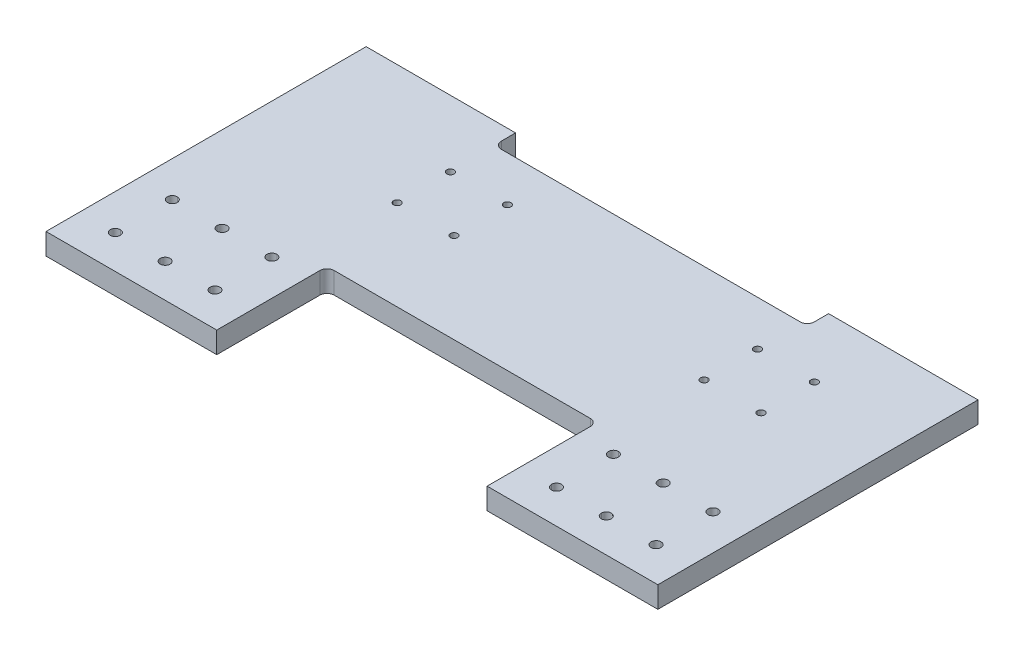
ISO-10303-21;
HEADER;
FILE_DESCRIPTION(('STEP AP214'),'2;1');
FILE_NAME('part.step','',(''),(''),'','','');
FILE_SCHEMA(('AUTOMOTIVE_DESIGN { 1 0 10303 214 1 1 1 1 }'));
ENDSEC;
DATA;
#1=APPLICATION_CONTEXT('core data for automotive mechanical design processes');
#2=APPLICATION_PROTOCOL_DEFINITION('international standard','automotive_design',2000,#1);
#3=PRODUCT_CONTEXT('',#1,'mechanical');
#4=PRODUCT('Part','Part','',(#3));
#5=PRODUCT_RELATED_PRODUCT_CATEGORY('part','',(#4));
#6=PRODUCT_DEFINITION_FORMATION('','',#4);
#7=PRODUCT_DEFINITION_CONTEXT('part definition',#1,'design');
#8=PRODUCT_DEFINITION('design','',#6,#7);
#9=PRODUCT_DEFINITION_SHAPE('','',#8);
#10=(LENGTH_UNIT() NAMED_UNIT(*) SI_UNIT(.MILLI.,.METRE.));
#11=(NAMED_UNIT(*) PLANE_ANGLE_UNIT() SI_UNIT($,.RADIAN.));
#12=(NAMED_UNIT(*) SI_UNIT($,.STERADIAN.) SOLID_ANGLE_UNIT());
#13=UNCERTAINTY_MEASURE_WITH_UNIT(LENGTH_MEASURE(1.E-05),#10,'distance_accuracy_value','');
#14=(GEOMETRIC_REPRESENTATION_CONTEXT(3) GLOBAL_UNCERTAINTY_ASSIGNED_CONTEXT((#13)) GLOBAL_UNIT_ASSIGNED_CONTEXT((#10,
#11,#12)) REPRESENTATION_CONTEXT('',''));
#15=CARTESIAN_POINT('',(0.,0.,0.));
#16=DIRECTION('',(0.,0.,1.));
#17=DIRECTION('',(1.,0.,0.));
#18=AXIS2_PLACEMENT_3D('',#15,#16,#17);
#19=CARTESIAN_POINT('',(729.994289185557,-5230.00062733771,-476.45017098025));
#20=DIRECTION('',(0.,-1.,0.));
#21=DIRECTION('',(1.,0.,0.));
#22=AXIS2_PLACEMENT_3D('',#19,#20,#21);
#23=PLANE('',#22);
#24=CARTESIAN_POINT('',(59.9941490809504,-5230.00062733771,-73.9501709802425));
#25=DIRECTION('',(0.,-1.,0.));
#26=DIRECTION('',(0.,0.,-1.));
#27=AXIS2_PLACEMENT_3D('',#24,#25,#26);
#28=CIRCLE('',#27,7.);
#29=CARTESIAN_POINT('',(52.9941490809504,-5230.00062733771,-73.9501709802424));
#30=VERTEX_POINT('',#29);
#31=CARTESIAN_POINT('',(66.9941490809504,-5230.00062733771,-73.9501709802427));
#32=VERTEX_POINT('',#31);
#33=EDGE_CURVE('E669',#30,#32,#28,.F.);
#34=ORIENTED_EDGE('',*,*,#33,.T.);
#35=CARTESIAN_POINT('',(59.9941490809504,-5230.00062733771,-73.9501709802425));
#36=DIRECTION('',(0.,-1.,0.));
#37=DIRECTION('',(0.,0.,-1.));
#38=AXIS2_PLACEMENT_3D('',#35,#36,#37);
#39=CIRCLE('',#38,7.);
#40=EDGE_CURVE('E375',#32,#30,#39,.F.);
#41=ORIENTED_EDGE('',*,*,#40,.T.);
#42=EDGE_LOOP('',(#34,#41));
#43=FACE_BOUND('',#42,.T.);
#44=CARTESIAN_POINT('',(-10.0058509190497,-5230.00062733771,-73.9501709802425));
#45=DIRECTION('',(0.,-1.,0.));
#46=DIRECTION('',(0.,0.,-1.));
#47=AXIS2_PLACEMENT_3D('',#44,#45,#46);
#48=CIRCLE('',#47,7.);
#49=CARTESIAN_POINT('',(-17.0058509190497,-5230.00062733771,-73.9501709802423));
#50=VERTEX_POINT('',#49);
#51=CARTESIAN_POINT('',(-3.00585091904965,-5230.00062733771,-73.9501709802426));
#52=VERTEX_POINT('',#51);
#53=EDGE_CURVE('E663',#50,#52,#48,.F.);
#54=ORIENTED_EDGE('',*,*,#53,.T.);
#55=CARTESIAN_POINT('',(-10.0058509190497,-5230.00062733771,-73.9501709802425));
#56=DIRECTION('',(0.,-1.,0.));
#57=DIRECTION('',(0.,0.,-1.));
#58=AXIS2_PLACEMENT_3D('',#55,#56,#57);
#59=CIRCLE('',#58,7.);
#60=EDGE_CURVE('E666',#52,#50,#59,.F.);
#61=ORIENTED_EDGE('',*,*,#60,.T.);
#62=EDGE_LOOP('',(#54,#61));
#63=FACE_BOUND('',#62,.T.);
#64=CARTESIAN_POINT('',(-80.0058509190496,-5230.00062733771,-73.9501709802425));
#65=DIRECTION('',(0.,-1.,0.));
#66=DIRECTION('',(1.,0.,0.));
#67=AXIS2_PLACEMENT_3D('',#64,#65,#66);
#68=CIRCLE('',#67,7.);
#69=CARTESIAN_POINT('',(-80.0058509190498,-5230.00062733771,-80.9501709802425));
#70=VERTEX_POINT('',#69);
#71=CARTESIAN_POINT('',(-80.0058509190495,-5230.00062733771,-66.9501709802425));
#72=VERTEX_POINT('',#71);
#73=EDGE_CURVE('E657',#70,#72,#68,.F.);
#74=ORIENTED_EDGE('',*,*,#73,.T.);
#75=CARTESIAN_POINT('',(-80.0058509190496,-5230.00062733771,-73.9501709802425));
#76=DIRECTION('',(0.,-1.,0.));
#77=DIRECTION('',(1.,0.,0.));
#78=AXIS2_PLACEMENT_3D('',#75,#76,#77);
#79=CIRCLE('',#78,7.);
#80=EDGE_CURVE('E660',#72,#70,#79,.F.);
#81=ORIENTED_EDGE('',*,*,#80,.T.);
#82=EDGE_LOOP('',(#74,#81));
#83=FACE_BOUND('',#82,.T.);
#84=CARTESIAN_POINT('',(59.9941490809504,-5230.00062733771,-153.950170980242));
#85=DIRECTION('',(0.,-1.,0.));
#86=DIRECTION('',(1.,0.,0.));
#87=AXIS2_PLACEMENT_3D('',#84,#85,#86);
#88=CIRCLE('',#87,7.);
#89=CARTESIAN_POINT('',(59.9941490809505,-5230.00062733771,-146.950170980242));
#90=VERTEX_POINT('',#89);
#91=CARTESIAN_POINT('',(59.9941490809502,-5230.00062733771,-160.950170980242));
#92=VERTEX_POINT('',#91);
#93=EDGE_CURVE('E651',#90,#92,#88,.F.);
#94=ORIENTED_EDGE('',*,*,#93,.T.);
#95=CARTESIAN_POINT('',(59.9941490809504,-5230.00062733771,-153.950170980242));
#96=DIRECTION('',(0.,-1.,0.));
#97=DIRECTION('',(1.,0.,0.));
#98=AXIS2_PLACEMENT_3D('',#95,#96,#97);
#99=CIRCLE('',#98,7.);
#100=EDGE_CURVE('E654',#92,#90,#99,.F.);
#101=ORIENTED_EDGE('',*,*,#100,.T.);
#102=EDGE_LOOP('',(#94,#101));
#103=FACE_BOUND('',#102,.T.);
#104=CARTESIAN_POINT('',(-10.0058509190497,-5230.00062733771,-153.950170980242));
#105=DIRECTION('',(0.,-1.,0.));
#106=DIRECTION('',(1.,0.,0.));
#107=AXIS2_PLACEMENT_3D('',#104,#105,#106);
#108=CIRCLE('',#107,7.);
#109=CARTESIAN_POINT('',(-3.00585091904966,-5230.00062733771,-153.950170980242));
#110=VERTEX_POINT('',#109);
#111=CARTESIAN_POINT('',(-17.0058509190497,-5230.00062733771,-153.950170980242));
#112=VERTEX_POINT('',#111);
#113=EDGE_CURVE('E645',#110,#112,#108,.F.);
#114=ORIENTED_EDGE('',*,*,#113,.T.);
#115=CARTESIAN_POINT('',(-10.0058509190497,-5230.00062733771,-153.950170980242));
#116=DIRECTION('',(0.,-1.,0.));
#117=DIRECTION('',(1.,0.,0.));
#118=AXIS2_PLACEMENT_3D('',#115,#116,#117);
#119=CIRCLE('',#118,7.);
#120=EDGE_CURVE('E648',#112,#110,#119,.F.);
#121=ORIENTED_EDGE('',*,*,#120,.T.);
#122=EDGE_LOOP('',(#114,#121));
#123=FACE_BOUND('',#122,.T.);
#124=CARTESIAN_POINT('',(-80.0058509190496,-5230.00062733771,-153.950170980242));
#125=DIRECTION('',(0.,-1.,0.));
#126=DIRECTION('',(1.,0.,0.));
#127=AXIS2_PLACEMENT_3D('',#124,#125,#126);
#128=CIRCLE('',#127,7.);
#129=CARTESIAN_POINT('',(-80.0058509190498,-5230.00062733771,-160.950170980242));
#130=VERTEX_POINT('',#129);
#131=CARTESIAN_POINT('',(-80.0058509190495,-5230.00062733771,-146.950170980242));
#132=VERTEX_POINT('',#131);
#133=EDGE_CURVE('E639',#130,#132,#128,.F.);
#134=ORIENTED_EDGE('',*,*,#133,.T.);
#135=CARTESIAN_POINT('',(-80.0058509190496,-5230.00062733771,-153.950170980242));
#136=DIRECTION('',(0.,-1.,0.));
#137=DIRECTION('',(1.,0.,0.));
#138=AXIS2_PLACEMENT_3D('',#135,#136,#137);
#139=CIRCLE('',#138,7.);
#140=EDGE_CURVE('E642',#132,#130,#139,.F.);
#141=ORIENTED_EDGE('',*,*,#140,.T.);
#142=EDGE_LOOP('',(#134,#141));
#143=FACE_BOUND('',#142,.T.);
#144=CARTESIAN_POINT('',(679.99414908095,-5230.00062733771,-73.9501709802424));
#145=DIRECTION('',(0.,-1.,0.));
#146=DIRECTION('',(1.,0.,0.));
#147=AXIS2_PLACEMENT_3D('',#144,#145,#146);
#148=CIRCLE('',#147,7.);
#149=CARTESIAN_POINT('',(679.99414908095,-5230.00062733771,-66.9501709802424));
#150=VERTEX_POINT('',#149);
#151=CARTESIAN_POINT('',(679.99414908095,-5230.00062733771,-80.9501709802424));
#152=VERTEX_POINT('',#151);
#153=EDGE_CURVE('E633',#150,#152,#148,.F.);
#154=ORIENTED_EDGE('',*,*,#153,.T.);
#155=CARTESIAN_POINT('',(679.99414908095,-5230.00062733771,-73.9501709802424));
#156=DIRECTION('',(0.,-1.,0.));
#157=DIRECTION('',(1.,0.,0.));
#158=AXIS2_PLACEMENT_3D('',#155,#156,#157);
#159=CIRCLE('',#158,7.);
#160=EDGE_CURVE('E636',#152,#150,#159,.F.);
#161=ORIENTED_EDGE('',*,*,#160,.T.);
#162=EDGE_LOOP('',(#154,#161));
#163=FACE_BOUND('',#162,.T.);
#164=CARTESIAN_POINT('',(679.99414908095,-5230.00062733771,-153.950170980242));
#165=DIRECTION('',(0.,-1.,0.));
#166=DIRECTION('',(1.,0.,0.));
#167=AXIS2_PLACEMENT_3D('',#164,#165,#166);
#168=CIRCLE('',#167,7.);
#169=CARTESIAN_POINT('',(679.99414908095,-5230.00062733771,-146.950170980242));
#170=VERTEX_POINT('',#169);
#171=CARTESIAN_POINT('',(679.99414908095,-5230.00062733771,-160.950170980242));
#172=VERTEX_POINT('',#171);
#173=EDGE_CURVE('E627',#170,#172,#168,.F.);
#174=ORIENTED_EDGE('',*,*,#173,.T.);
#175=CARTESIAN_POINT('',(679.99414908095,-5230.00062733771,-153.950170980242));
#176=DIRECTION('',(0.,-1.,0.));
#177=DIRECTION('',(1.,0.,0.));
#178=AXIS2_PLACEMENT_3D('',#175,#176,#177);
#179=CIRCLE('',#178,7.);
#180=EDGE_CURVE('E630',#172,#170,#179,.F.);
#181=ORIENTED_EDGE('',*,*,#180,.T.);
#182=EDGE_LOOP('',(#174,#181));
#183=FACE_BOUND('',#182,.T.);
#184=CARTESIAN_POINT('',(609.99414908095,-5230.00062733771,-153.950170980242));
#185=DIRECTION('',(0.,-1.,0.));
#186=DIRECTION('',(1.,0.,0.));
#187=AXIS2_PLACEMENT_3D('',#184,#185,#186);
#188=CIRCLE('',#187,7.);
#189=CARTESIAN_POINT('',(616.99414908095,-5230.00062733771,-153.950170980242));
#190=VERTEX_POINT('',#189);
#191=CARTESIAN_POINT('',(602.99414908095,-5230.00062733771,-153.950170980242));
#192=VERTEX_POINT('',#191);
#193=EDGE_CURVE('E621',#190,#192,#188,.F.);
#194=ORIENTED_EDGE('',*,*,#193,.T.);
#195=CARTESIAN_POINT('',(609.99414908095,-5230.00062733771,-153.950170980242));
#196=DIRECTION('',(0.,-1.,0.));
#197=DIRECTION('',(1.,0.,0.));
#198=AXIS2_PLACEMENT_3D('',#195,#196,#197);
#199=CIRCLE('',#198,7.);
#200=EDGE_CURVE('E624',#192,#190,#199,.F.);
#201=ORIENTED_EDGE('',*,*,#200,.T.);
#202=EDGE_LOOP('',(#194,#201));
#203=FACE_BOUND('',#202,.T.);
#204=CARTESIAN_POINT('',(609.99414908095,-5230.00062733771,-73.9501709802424));
#205=DIRECTION('',(0.,-1.,0.));
#206=DIRECTION('',(0.,0.,-1.));
#207=AXIS2_PLACEMENT_3D('',#204,#205,#206);
#208=CIRCLE('',#207,7.);
#209=CARTESIAN_POINT('',(602.99414908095,-5230.00062733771,-73.9501709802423));
#210=VERTEX_POINT('',#209);
#211=CARTESIAN_POINT('',(616.99414908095,-5230.00062733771,-73.9501709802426));
#212=VERTEX_POINT('',#211);
#213=EDGE_CURVE('E615',#210,#212,#208,.F.);
#214=ORIENTED_EDGE('',*,*,#213,.T.);
#215=CARTESIAN_POINT('',(609.99414908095,-5230.00062733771,-73.9501709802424));
#216=DIRECTION('',(0.,-1.,0.));
#217=DIRECTION('',(0.,0.,-1.));
#218=AXIS2_PLACEMENT_3D('',#215,#216,#217);
#219=CIRCLE('',#218,7.);
#220=EDGE_CURVE('E618',#212,#210,#219,.F.);
#221=ORIENTED_EDGE('',*,*,#220,.T.);
#222=EDGE_LOOP('',(#214,#221));
#223=FACE_BOUND('',#222,.T.);
#224=CARTESIAN_POINT('',(539.99414908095,-5230.00062733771,-73.9501709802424));
#225=DIRECTION('',(0.,-1.,0.));
#226=DIRECTION('',(0.,0.,-1.));
#227=AXIS2_PLACEMENT_3D('',#224,#225,#226);
#228=CIRCLE('',#227,7.);
#229=CARTESIAN_POINT('',(532.99414908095,-5230.00062733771,-73.9501709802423));
#230=VERTEX_POINT('',#229);
#231=CARTESIAN_POINT('',(546.99414908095,-5230.00062733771,-73.9501709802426));
#232=VERTEX_POINT('',#231);
#233=EDGE_CURVE('E609',#230,#232,#228,.F.);
#234=ORIENTED_EDGE('',*,*,#233,.T.);
#235=CARTESIAN_POINT('',(539.99414908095,-5230.00062733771,-73.9501709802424));
#236=DIRECTION('',(0.,-1.,0.));
#237=DIRECTION('',(0.,0.,-1.));
#238=AXIS2_PLACEMENT_3D('',#235,#236,#237);
#239=CIRCLE('',#238,7.);
#240=EDGE_CURVE('E612',#232,#230,#239,.F.);
#241=ORIENTED_EDGE('',*,*,#240,.T.);
#242=EDGE_LOOP('',(#234,#241));
#243=FACE_BOUND('',#242,.T.);
#244=CARTESIAN_POINT('',(539.99414908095,-5230.00062733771,-153.950170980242));
#245=DIRECTION('',(0.,-1.,0.));
#246=DIRECTION('',(1.,0.,0.));
#247=AXIS2_PLACEMENT_3D('',#244,#245,#246);
#248=CIRCLE('',#247,7.);
#249=CARTESIAN_POINT('',(539.99414908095,-5230.00062733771,-160.950170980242));
#250=VERTEX_POINT('',#249);
#251=CARTESIAN_POINT('',(539.99414908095,-5230.00062733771,-146.950170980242));
#252=VERTEX_POINT('',#251);
#253=EDGE_CURVE('E603',#250,#252,#248,.F.);
#254=ORIENTED_EDGE('',*,*,#253,.T.);
#255=CARTESIAN_POINT('',(539.99414908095,-5230.00062733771,-153.950170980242));
#256=DIRECTION('',(0.,-1.,0.));
#257=DIRECTION('',(1.,0.,0.));
#258=AXIS2_PLACEMENT_3D('',#255,#256,#257);
#259=CIRCLE('',#258,7.);
#260=EDGE_CURVE('E606',#252,#250,#259,.F.);
#261=ORIENTED_EDGE('',*,*,#260,.T.);
#262=EDGE_LOOP('',(#254,#261));
#263=FACE_BOUND('',#262,.T.);
#264=CARTESIAN_POINT('',(513.247937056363,-5230.00062733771,-308.19638300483));
#265=DIRECTION('',(0.,-1.,0.));
#266=DIRECTION('',(1.,0.,0.));
#267=AXIS2_PLACEMENT_3D('',#264,#265,#266);
#268=CIRCLE('',#267,5.1);
#269=CARTESIAN_POINT('',(513.247937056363,-5230.00062733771,-313.29638300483));
#270=VERTEX_POINT('',#269);
#271=CARTESIAN_POINT('',(513.247937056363,-5230.00062733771,-303.09638300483));
#272=VERTEX_POINT('',#271);
#273=EDGE_CURVE('E597',#270,#272,#268,.F.);
#274=ORIENTED_EDGE('',*,*,#273,.T.);
#275=CARTESIAN_POINT('',(513.247937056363,-5230.00062733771,-308.19638300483));
#276=DIRECTION('',(0.,-1.,0.));
#277=DIRECTION('',(1.,0.,0.));
#278=AXIS2_PLACEMENT_3D('',#275,#276,#277);
#279=CIRCLE('',#278,5.1);
#280=EDGE_CURVE('E600',#272,#270,#279,.F.);
#281=ORIENTED_EDGE('',*,*,#280,.T.);
#282=EDGE_LOOP('',(#274,#281));
#283=FACE_BOUND('',#282,.T.);
#284=CARTESIAN_POINT('',(593.247937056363,-5230.00062733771,-308.19638300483));
#285=DIRECTION('',(0.,-1.,0.));
#286=DIRECTION('',(1.,0.,0.));
#287=AXIS2_PLACEMENT_3D('',#284,#285,#286);
#288=CIRCLE('',#287,5.1);
#289=CARTESIAN_POINT('',(598.347937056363,-5230.00062733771,-308.19638300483));
#290=VERTEX_POINT('',#289);
#291=CARTESIAN_POINT('',(588.147937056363,-5230.00062733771,-308.19638300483));
#292=VERTEX_POINT('',#291);
#293=EDGE_CURVE('E591',#290,#292,#288,.F.);
#294=ORIENTED_EDGE('',*,*,#293,.T.);
#295=CARTESIAN_POINT('',(593.247937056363,-5230.00062733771,-308.19638300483));
#296=DIRECTION('',(0.,-1.,0.));
#297=DIRECTION('',(1.,0.,0.));
#298=AXIS2_PLACEMENT_3D('',#295,#296,#297);
#299=CIRCLE('',#298,5.1);
#300=EDGE_CURVE('E594',#292,#290,#299,.F.);
#301=ORIENTED_EDGE('',*,*,#300,.T.);
#302=EDGE_LOOP('',(#294,#301));
#303=FACE_BOUND('',#302,.T.);
#304=CARTESIAN_POINT('',(513.247937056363,-5230.00062733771,-383.19638300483));
#305=DIRECTION('',(0.,-1.,0.));
#306=DIRECTION('',(1.,0.,0.));
#307=AXIS2_PLACEMENT_3D('',#304,#305,#306);
#308=CIRCLE('',#307,5.1);
#309=CARTESIAN_POINT('',(518.347937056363,-5230.00062733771,-383.19638300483));
#310=VERTEX_POINT('',#309);
#311=CARTESIAN_POINT('',(508.147937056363,-5230.00062733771,-383.19638300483));
#312=VERTEX_POINT('',#311);
#313=EDGE_CURVE('E585',#310,#312,#308,.F.);
#314=ORIENTED_EDGE('',*,*,#313,.T.);
#315=CARTESIAN_POINT('',(513.247937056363,-5230.00062733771,-383.19638300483));
#316=DIRECTION('',(0.,-1.,0.));
#317=DIRECTION('',(1.,0.,0.));
#318=AXIS2_PLACEMENT_3D('',#315,#316,#317);
#319=CIRCLE('',#318,5.1);
#320=EDGE_CURVE('E588',#312,#310,#319,.F.);
#321=ORIENTED_EDGE('',*,*,#320,.T.);
#322=EDGE_LOOP('',(#314,#321));
#323=FACE_BOUND('',#322,.T.);
#324=CARTESIAN_POINT('',(593.247937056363,-5230.00062733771,-383.19638300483));
#325=DIRECTION('',(0.,-1.,0.));
#326=DIRECTION('',(1.,0.,0.));
#327=AXIS2_PLACEMENT_3D('',#324,#325,#326);
#328=CIRCLE('',#327,5.1);
#329=CARTESIAN_POINT('',(598.347937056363,-5230.00062733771,-383.19638300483));
#330=VERTEX_POINT('',#329);
#331=CARTESIAN_POINT('',(588.147937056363,-5230.00062733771,-383.19638300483));
#332=VERTEX_POINT('',#331);
#333=EDGE_CURVE('E579',#330,#332,#328,.F.);
#334=ORIENTED_EDGE('',*,*,#333,.T.);
#335=CARTESIAN_POINT('',(593.247937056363,-5230.00062733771,-383.19638300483));
#336=DIRECTION('',(0.,-1.,0.));
#337=DIRECTION('',(1.,0.,0.));
#338=AXIS2_PLACEMENT_3D('',#335,#336,#337);
#339=CIRCLE('',#338,5.1);
#340=EDGE_CURVE('E582',#332,#330,#339,.F.);
#341=ORIENTED_EDGE('',*,*,#340,.T.);
#342=EDGE_LOOP('',(#334,#341));
#343=FACE_BOUND('',#342,.T.);
#344=CARTESIAN_POINT('',(161.742105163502,-5230.00062733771,-308.202894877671));
#345=DIRECTION('',(0.,-1.,0.));
#346=DIRECTION('',(0.,0.,-1.));
#347=AXIS2_PLACEMENT_3D('',#344,#345,#346);
#348=CIRCLE('',#347,5.1);
#349=CARTESIAN_POINT('',(166.842105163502,-5230.00062733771,-308.202894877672));
#350=VERTEX_POINT('',#349);
#351=CARTESIAN_POINT('',(156.642105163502,-5230.00062733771,-308.202894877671));
#352=VERTEX_POINT('',#351);
#353=EDGE_CURVE('E573',#350,#352,#348,.F.);
#354=ORIENTED_EDGE('',*,*,#353,.T.);
#355=CARTESIAN_POINT('',(161.742105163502,-5230.00062733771,-308.202894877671));
#356=DIRECTION('',(0.,-1.,0.));
#357=DIRECTION('',(0.,0.,-1.));
#358=AXIS2_PLACEMENT_3D('',#355,#356,#357);
#359=CIRCLE('',#358,5.1);
#360=EDGE_CURVE('E576',#352,#350,#359,.F.);
#361=ORIENTED_EDGE('',*,*,#360,.T.);
#362=EDGE_LOOP('',(#354,#361));
#363=FACE_BOUND('',#362,.T.);
#364=CARTESIAN_POINT('',(161.744884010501,-5230.00062733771,-383.202894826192));
#365=DIRECTION('',(0.,-1.,0.));
#366=DIRECTION('',(0.,0.,-1.));
#367=AXIS2_PLACEMENT_3D('',#364,#365,#366);
#368=CIRCLE('',#367,5.1);
#369=CARTESIAN_POINT('',(166.844884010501,-5230.00062733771,-383.202894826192));
#370=VERTEX_POINT('',#369);
#371=CARTESIAN_POINT('',(156.644884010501,-5230.00062733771,-383.202894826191));
#372=VERTEX_POINT('',#371);
#373=EDGE_CURVE('E567',#370,#372,#368,.F.);
#374=ORIENTED_EDGE('',*,*,#373,.T.);
#375=CARTESIAN_POINT('',(161.744884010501,-5230.00062733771,-383.202894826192));
#376=DIRECTION('',(0.,-1.,0.));
#377=DIRECTION('',(0.,0.,-1.));
#378=AXIS2_PLACEMENT_3D('',#375,#376,#377);
#379=CIRCLE('',#378,5.1);
#380=EDGE_CURVE('E570',#372,#370,#379,.F.);
#381=ORIENTED_EDGE('',*,*,#380,.T.);
#382=EDGE_LOOP('',(#374,#381));
#383=FACE_BOUND('',#382,.T.);
#384=CARTESIAN_POINT('',(81.7448840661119,-5230.00062733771,-383.205858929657));
#385=DIRECTION('',(0.,-1.,0.));
#386=DIRECTION('',(0.,0.,-1.));
#387=AXIS2_PLACEMENT_3D('',#384,#385,#386);
#388=CIRCLE('',#387,5.1);
#389=CARTESIAN_POINT('',(86.8448840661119,-5230.00062733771,-383.205858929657));
#390=VERTEX_POINT('',#389);
#391=CARTESIAN_POINT('',(76.6448840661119,-5230.00062733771,-383.205858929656));
#392=VERTEX_POINT('',#391);
#393=EDGE_CURVE('E561',#390,#392,#388,.F.);
#394=ORIENTED_EDGE('',*,*,#393,.T.);
#395=CARTESIAN_POINT('',(81.7448840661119,-5230.00062733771,-383.205858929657));
#396=DIRECTION('',(0.,-1.,0.));
#397=DIRECTION('',(0.,0.,-1.));
#398=AXIS2_PLACEMENT_3D('',#395,#396,#397);
#399=CIRCLE('',#398,5.1);
#400=EDGE_CURVE('E564',#392,#390,#399,.F.);
#401=ORIENTED_EDGE('',*,*,#400,.T.);
#402=EDGE_LOOP('',(#394,#401));
#403=FACE_BOUND('',#402,.T.);
#404=CARTESIAN_POINT('',(81.7421052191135,-5230.00062733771,-308.205858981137));
#405=DIRECTION('',(0.,-1.,0.));
#406=DIRECTION('',(0.,0.,-1.));
#407=AXIS2_PLACEMENT_3D('',#404,#405,#406);
#408=CIRCLE('',#407,5.1);
#409=CARTESIAN_POINT('',(86.8421052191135,-5230.00062733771,-308.205858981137));
#410=VERTEX_POINT('',#409);
#411=CARTESIAN_POINT('',(76.6421052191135,-5230.00062733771,-308.205858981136));
#412=VERTEX_POINT('',#411);
#413=EDGE_CURVE('E556',#410,#412,#408,.F.);
#414=ORIENTED_EDGE('',*,*,#413,.T.);
#415=CARTESIAN_POINT('',(81.7421052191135,-5230.00062733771,-308.205858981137));
#416=DIRECTION('',(0.,-1.,0.));
#417=DIRECTION('',(0.,0.,-1.));
#418=AXIS2_PLACEMENT_3D('',#415,#416,#417);
#419=CIRCLE('',#418,5.1);
#420=EDGE_CURVE('E558',#412,#410,#419,.F.);
#421=ORIENTED_EDGE('',*,*,#420,.T.);
#422=EDGE_LOOP('',(#414,#421));
#423=FACE_BOUND('',#422,.T.);
#424=DIRECTION('',(1.,0.,0.));
#425=VECTOR('',#424,1.);
#426=CARTESIAN_POINT('',(509.994289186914,-5230.00062733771,-446.450170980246));
#427=LINE('',#426,#425);
#428=CARTESIAN_POINT('',(89.9942891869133,-5230.00062733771,-446.450170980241));
#429=VERTEX_POINT('',#428);
#430=CARTESIAN_POINT('',(509.994289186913,-5230.00062733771,-446.450170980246));
#431=VERTEX_POINT('',#430);
#432=EDGE_CURVE('E329',#429,#431,#427,.T.);
#433=ORIENTED_EDGE('',*,*,#432,.T.);
#434=CARTESIAN_POINT('',(509.994289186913,-5230.00062733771,-456.450170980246));
#435=DIRECTION('',(0.,1.,0.));
#436=DIRECTION('',(0.,0.,1.));
#437=AXIS2_PLACEMENT_3D('',#434,#435,#436);
#438=CIRCLE('',#437,10.);
#439=CARTESIAN_POINT('',(519.994289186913,-5230.00062733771,-456.450170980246));
#440=VERTEX_POINT('',#439);
#441=EDGE_CURVE('E20',#431,#440,#438,.T.);
#442=ORIENTED_EDGE('',*,*,#441,.T.);
#443=DIRECTION('',(0.,0.,-1.));
#444=VECTOR('',#443,1.);
#445=CARTESIAN_POINT('',(519.994289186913,-5230.00062733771,-476.450170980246));
#446=LINE('',#445,#444);
#447=CARTESIAN_POINT('',(519.994289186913,-5230.00062733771,-476.450170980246));
#448=VERTEX_POINT('',#447);
#449=EDGE_CURVE('E335',#440,#448,#446,.T.);
#450=ORIENTED_EDGE('',*,*,#449,.T.);
#451=DIRECTION('',(-1.,0.,0.));
#452=VECTOR('',#451,1.);
#453=CARTESIAN_POINT('',(-130.005710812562,-5230.00062733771,-476.450170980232));
#454=LINE('',#453,#452);
#455=CARTESIAN_POINT('',(729.994289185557,-5230.00062733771,-476.450170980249));
#456=VERTEX_POINT('',#455);
#457=EDGE_CURVE('E373',#456,#448,#454,.T.);
#458=ORIENTED_EDGE('',*,*,#457,.F.);
#459=DIRECTION('',(0.,0.,-1.));
#460=VECTOR('',#459,1.);
#461=CARTESIAN_POINT('',(729.994289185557,-5230.00062733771,-476.45017098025));
#462=LINE('',#461,#460);
#463=CARTESIAN_POINT('',(729.994289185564,-5230.00062733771,-26.4501709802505));
#464=VERTEX_POINT('',#463);
#465=EDGE_CURVE('E361',#464,#456,#462,.T.);
#466=ORIENTED_EDGE('',*,*,#465,.F.);
#467=DIRECTION('',(1.,0.,0.));
#468=VECTOR('',#467,1.);
#469=CARTESIAN_POINT('',(729.994289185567,-5230.00062733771,-26.4501709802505));
#470=LINE('',#469,#468);
#471=CARTESIAN_POINT('',(489.994289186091,-5230.00062733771,-26.4501709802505));
#472=VERTEX_POINT('',#471);
#473=EDGE_CURVE('E385',#472,#464,#470,.T.);
#474=ORIENTED_EDGE('',*,*,#473,.F.);
#475=DIRECTION('',(0.,0.,1.));
#476=VECTOR('',#475,1.);
#477=CARTESIAN_POINT('',(489.994289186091,-5230.00062733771,-26.4501709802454));
#478=LINE('',#477,#476);
#479=CARTESIAN_POINT('',(489.994289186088,-5230.00062733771,-171.450170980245));
#480=VERTEX_POINT('',#479);
#481=EDGE_CURVE('E378',#480,#472,#478,.T.);
#482=ORIENTED_EDGE('',*,*,#481,.F.);
#483=CARTESIAN_POINT('',(479.994289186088,-5230.00062733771,-171.450170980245));
#484=DIRECTION('',(0.,-1.,0.));
#485=DIRECTION('',(0.,0.,-1.));
#486=AXIS2_PLACEMENT_3D('',#483,#484,#485);
#487=CIRCLE('',#486,10.);
#488=CARTESIAN_POINT('',(479.994289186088,-5230.00062733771,-181.450170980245));
#489=VERTEX_POINT('',#488);
#490=EDGE_CURVE('E673',#489,#480,#487,.T.);
#491=ORIENTED_EDGE('',*,*,#490,.F.);
#492=DIRECTION('',(1.,0.,0.));
#493=VECTOR('',#492,1.);
#494=CARTESIAN_POINT('',(489.994289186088,-5230.00062733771,-181.450170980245));
#495=LINE('',#494,#493);
#496=CARTESIAN_POINT('',(119.994289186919,-5230.00062733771,-181.450170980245));
#497=VERTEX_POINT('',#496);
#498=EDGE_CURVE('E391',#497,#489,#495,.T.);
#499=ORIENTED_EDGE('',*,*,#498,.F.);
#500=CARTESIAN_POINT('',(119.994289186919,-5230.00062733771,-171.450170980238));
#501=DIRECTION('',(0.,-1.,0.));
#502=DIRECTION('',(1.,0.,0.));
#503=AXIS2_PLACEMENT_3D('',#500,#501,#502);
#504=CIRCLE('',#503,10.);
#505=CARTESIAN_POINT('',(109.994289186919,-5230.00062733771,-171.450170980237));
#506=VERTEX_POINT('',#505);
#507=EDGE_CURVE('E675',#506,#497,#504,.T.);
#508=ORIENTED_EDGE('',*,*,#507,.F.);
#509=DIRECTION('',(0.,0.,-1.));
#510=VECTOR('',#509,1.);
#511=CARTESIAN_POINT('',(109.994289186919,-5230.00062733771,-181.450170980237));
#512=LINE('',#511,#510);
#513=CARTESIAN_POINT('',(109.994289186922,-5230.00062733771,-26.4501709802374));
#514=VERTEX_POINT('',#513);
#515=EDGE_CURVE('E395',#514,#506,#512,.T.);
#516=ORIENTED_EDGE('',*,*,#515,.F.);
#517=DIRECTION('',(1.,0.,0.));
#518=VECTOR('',#517,1.);
#519=CARTESIAN_POINT('',(109.994289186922,-5230.00062733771,-26.4501709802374));
#520=LINE('',#519,#518);
#521=CARTESIAN_POINT('',(-130.005710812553,-5230.00062733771,-26.4501709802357));
#522=VERTEX_POINT('',#521);
#523=EDGE_CURVE('E401',#522,#514,#520,.T.);
#524=ORIENTED_EDGE('',*,*,#523,.F.);
#525=DIRECTION('',(0.,0.,1.));
#526=VECTOR('',#525,1.);
#527=CARTESIAN_POINT('',(-130.005710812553,-5230.00062733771,-26.4501709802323));
#528=LINE('',#527,#526);
#529=CARTESIAN_POINT('',(-130.005710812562,-5230.00062733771,-476.450170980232));
#530=VERTEX_POINT('',#529);
#531=EDGE_CURVE('E407',#530,#522,#528,.T.);
#532=ORIENTED_EDGE('',*,*,#531,.F.);
#533=DIRECTION('',(-1.,0.,0.));
#534=VECTOR('',#533,1.);
#535=CARTESIAN_POINT('',(-130.005710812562,-5230.00062733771,-476.450170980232));
#536=LINE('',#535,#534);
#537=CARTESIAN_POINT('',(79.9942891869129,-5230.00062733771,-476.450170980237));
#538=VERTEX_POINT('',#537);
#539=EDGE_CURVE('E413',#538,#530,#536,.T.);
#540=ORIENTED_EDGE('',*,*,#539,.F.);
#541=DIRECTION('',(0.,0.,1.));
#542=VECTOR('',#541,1.);
#543=CARTESIAN_POINT('',(79.9942891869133,-5230.00062733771,-456.450170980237));
#544=LINE('',#543,#542);
#545=CARTESIAN_POINT('',(79.9942891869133,-5230.00062733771,-456.450170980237));
#546=VERTEX_POINT('',#545);
#547=EDGE_CURVE('E419',#538,#546,#544,.T.);
#548=ORIENTED_EDGE('',*,*,#547,.T.);
#549=CARTESIAN_POINT('',(89.9942891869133,-5230.00062733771,-456.450170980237));
#550=DIRECTION('',(0.,1.,0.));
#551=DIRECTION('',(0.,0.,1.));
#552=AXIS2_PLACEMENT_3D('',#549,#550,#551);
#553=CIRCLE('',#552,10.);
#554=EDGE_CURVE('E676',#546,#429,#553,.T.);
#555=ORIENTED_EDGE('',*,*,#554,.T.);
#556=EDGE_LOOP('',(#433,#442,#450,#458,#466,#474,#482,#491,#499,#508,#516,#524,#532,#540,#548,#555));
#557=FACE_BOUND('',#556,.T.);
#558=ADVANCED_FACE('F17',(#43,#63,#83,#103,#123,#143,#163,#183,#203,#223,#243,#263,#283,#303,
#323,#343,#363,#383,#403,#423,#557),#23,.T.);
#559=CARTESIAN_POINT('',(519.994289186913,-5230.00062733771,-476.450170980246));
#560=DIRECTION('',(1.,0.,0.));
#561=DIRECTION('',(0.,0.,-1.));
#562=AXIS2_PLACEMENT_3D('',#559,#560,#561);
#563=PLANE('',#562);
#564=DIRECTION('',(0.,1.,0.));
#565=VECTOR('',#564,1.);
#566=CARTESIAN_POINT('',(519.994289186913,-5200.00062733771,-476.450170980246));
#567=LINE('',#566,#565);
#568=CARTESIAN_POINT('',(519.994289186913,-5200.00062733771,-476.450170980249));
#569=VERTEX_POINT('',#568);
#570=EDGE_CURVE('E346',#448,#569,#567,.T.);
#571=ORIENTED_EDGE('',*,*,#570,.F.);
#572=ORIENTED_EDGE('',*,*,#449,.F.);
#573=DIRECTION('',(0.,1.,0.));
#574=VECTOR('',#573,1.);
#575=CARTESIAN_POINT('',(519.994289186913,-5230.00062733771,-456.450170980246));
#576=LINE('',#575,#574);
#577=CARTESIAN_POINT('',(519.994289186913,-5200.00062733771,-456.450170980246));
#578=VERTEX_POINT('',#577);
#579=EDGE_CURVE('E340',#440,#578,#576,.T.);
#580=ORIENTED_EDGE('',*,*,#579,.T.);
#581=DIRECTION('',(0.,0.,1.));
#582=VECTOR('',#581,1.);
#583=CARTESIAN_POINT('',(519.994289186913,-5200.00062733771,-26.4501709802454));
#584=LINE('',#583,#582);
#585=EDGE_CURVE('E555',#569,#578,#584,.T.);
#586=ORIENTED_EDGE('',*,*,#585,.F.);
#587=EDGE_LOOP('',(#571,#572,#580,#586));
#588=FACE_BOUND('',#587,.T.);
#589=ADVANCED_FACE('F342',(#588),#563,.F.);
#590=CARTESIAN_POINT('',(509.994289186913,-5230.00062733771,-456.450170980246));
#591=DIRECTION('',(0.,1.,0.));
#592=DIRECTION('',(0.,0.,1.));
#593=AXIS2_PLACEMENT_3D('',#590,#591,#592);
#594=CYLINDRICAL_SURFACE('',#593,10.);
#595=ORIENTED_EDGE('',*,*,#579,.F.);
#596=ORIENTED_EDGE('',*,*,#441,.F.);
#597=DIRECTION('',(0.,-1.,0.));
#598=VECTOR('',#597,1.);
#599=CARTESIAN_POINT('',(509.994289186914,-5230.00062733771,-446.450170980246));
#600=LINE('',#599,#598);
#601=CARTESIAN_POINT('',(509.994289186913,-5200.00062733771,-446.450170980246));
#602=VERTEX_POINT('',#601);
#603=EDGE_CURVE('E354',#431,#602,#600,.F.);
#604=ORIENTED_EDGE('',*,*,#603,.T.);
#605=CARTESIAN_POINT('',(509.994289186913,-5200.00062733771,-456.450170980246));
#606=DIRECTION('',(0.,1.,0.));
#607=DIRECTION('',(0.,0.,1.));
#608=AXIS2_PLACEMENT_3D('',#605,#606,#607);
#609=CIRCLE('',#608,10.);
#610=EDGE_CURVE('E351',#578,#602,#609,.F.);
#611=ORIENTED_EDGE('',*,*,#610,.F.);
#612=EDGE_LOOP('',(#595,#596,#604,#611));
#613=FACE_BOUND('',#612,.T.);
#614=ADVANCED_FACE('F349',(#613),#594,.F.);
#615=CARTESIAN_POINT('',(509.994289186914,-5230.00062733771,-446.450170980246));
#616=DIRECTION('',(0.,0.,1.));
#617=DIRECTION('',(0.,-1.,0.));
#618=AXIS2_PLACEMENT_3D('',#615,#616,#617);
#619=PLANE('',#618);
#620=ORIENTED_EDGE('',*,*,#603,.F.);
#621=ORIENTED_EDGE('',*,*,#432,.F.);
#622=DIRECTION('',(0.,1.,0.));
#623=VECTOR('',#622,1.);
#624=CARTESIAN_POINT('',(89.9942891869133,-5230.00062733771,-446.450170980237));
#625=LINE('',#624,#623);
#626=CARTESIAN_POINT('',(89.9942891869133,-5200.00062733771,-446.450170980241));
#627=VERTEX_POINT('',#626);
#628=EDGE_CURVE('E422',#429,#627,#625,.T.);
#629=ORIENTED_EDGE('',*,*,#628,.T.);
#630=DIRECTION('',(1.,0.,0.));
#631=VECTOR('',#630,1.);
#632=CARTESIAN_POINT('',(489.994289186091,-5200.00062733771,-446.450170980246));
#633=LINE('',#632,#631);
#634=EDGE_CURVE('E553',#602,#627,#633,.F.);
#635=ORIENTED_EDGE('',*,*,#634,.F.);
#636=EDGE_LOOP('',(#620,#621,#629,#635));
#637=FACE_BOUND('',#636,.T.);
#638=ADVANCED_FACE('F681',(#637),#619,.F.);
#639=CARTESIAN_POINT('',(89.9942891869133,-5230.00062733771,-456.450170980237));
#640=DIRECTION('',(0.,1.,0.));
#641=DIRECTION('',(0.,0.,1.));
#642=AXIS2_PLACEMENT_3D('',#639,#640,#641);
#643=CYLINDRICAL_SURFACE('',#642,10.);
#644=ORIENTED_EDGE('',*,*,#628,.F.);
#645=ORIENTED_EDGE('',*,*,#554,.F.);
#646=DIRECTION('',(0.,1.,0.));
#647=VECTOR('',#646,1.);
#648=CARTESIAN_POINT('',(79.9942891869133,-5230.00062733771,-456.450170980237));
#649=LINE('',#648,#647);
#650=CARTESIAN_POINT('',(79.9942891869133,-5200.00062733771,-456.450170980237));
#651=VERTEX_POINT('',#650);
#652=EDGE_CURVE('E421',#546,#651,#649,.T.);
#653=ORIENTED_EDGE('',*,*,#652,.T.);
#654=CARTESIAN_POINT('',(89.9942891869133,-5200.00062733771,-456.450170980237));
#655=DIRECTION('',(0.,1.,0.));
#656=DIRECTION('',(0.,0.,1.));
#657=AXIS2_PLACEMENT_3D('',#654,#655,#656);
#658=CIRCLE('',#657,10.);
#659=EDGE_CURVE('E549',#627,#651,#658,.F.);
#660=ORIENTED_EDGE('',*,*,#659,.F.);
#661=EDGE_LOOP('',(#644,#645,#653,#660));
#662=FACE_BOUND('',#661,.T.);
#663=ADVANCED_FACE('F812',(#662),#643,.F.);
#664=CARTESIAN_POINT('',(79.9942891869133,-5230.00062733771,-456.450170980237));
#665=DIRECTION('',(-1.,0.,0.));
#666=DIRECTION('',(0.,0.,1.));
#667=AXIS2_PLACEMENT_3D('',#664,#665,#666);
#668=PLANE('',#667);
#669=ORIENTED_EDGE('',*,*,#652,.F.);
#670=ORIENTED_EDGE('',*,*,#547,.F.);
#671=DIRECTION('',(0.,1.,0.));
#672=VECTOR('',#671,1.);
#673=CARTESIAN_POINT('',(79.9942891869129,-5200.00062733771,-476.450170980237));
#674=LINE('',#673,#672);
#675=CARTESIAN_POINT('',(79.9942891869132,-5200.00062733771,-476.450170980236));
#676=VERTEX_POINT('',#675);
#677=EDGE_CURVE('E416',#676,#538,#674,.F.);
#678=ORIENTED_EDGE('',*,*,#677,.F.);
#679=DIRECTION('',(0.,0.,1.));
#680=VECTOR('',#679,1.);
#681=CARTESIAN_POINT('',(79.9942891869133,-5200.00062733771,-26.4501709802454));
#682=LINE('',#681,#680);
#683=EDGE_CURVE('E552',#651,#676,#682,.F.);
#684=ORIENTED_EDGE('',*,*,#683,.F.);
#685=EDGE_LOOP('',(#669,#670,#678,#684));
#686=FACE_BOUND('',#685,.T.);
#687=ADVANCED_FACE('F817',(#686),#668,.F.);
#688=CARTESIAN_POINT('',(-130.005710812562,-5200.00062733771,-476.450170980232));
#689=DIRECTION('',(0.,0.,-1.));
#690=DIRECTION('',(-1.,0.,0.));
#691=AXIS2_PLACEMENT_3D('',#688,#689,#690);
#692=PLANE('',#691);
#693=DIRECTION('',(0.,1.,0.));
#694=VECTOR('',#693,1.);
#695=CARTESIAN_POINT('',(-130.005710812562,-5200.00062733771,-476.450170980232));
#696=LINE('',#695,#694);
#697=CARTESIAN_POINT('',(-130.005710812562,-5200.00062733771,-476.450170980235));
#698=VERTEX_POINT('',#697);
#699=EDGE_CURVE('E410',#698,#530,#696,.F.);
#700=ORIENTED_EDGE('',*,*,#699,.F.);
#701=DIRECTION('',(1.,0.,0.));
#702=VECTOR('',#701,1.);
#703=CARTESIAN_POINT('',(489.994289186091,-5200.00062733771,-476.450170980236));
#704=LINE('',#703,#702);
#705=EDGE_CURVE('E794',#676,#698,#704,.F.);
#706=ORIENTED_EDGE('',*,*,#705,.F.);
#707=ORIENTED_EDGE('',*,*,#677,.T.);
#708=ORIENTED_EDGE('',*,*,#539,.T.);
#709=EDGE_LOOP('',(#700,#706,#707,#708));
#710=FACE_BOUND('',#709,.T.);
#711=ADVANCED_FACE('F868',(#710),#692,.T.);
#712=CARTESIAN_POINT('',(-130.005710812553,-5200.00062733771,-26.4501709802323));
#713=DIRECTION('',(-1.,0.,0.));
#714=DIRECTION('',(0.,0.,1.));
#715=AXIS2_PLACEMENT_3D('',#712,#713,#714);
#716=PLANE('',#715);
#717=ORIENTED_EDGE('',*,*,#531,.T.);
#718=DIRECTION('',(0.,-1.,0.));
#719=VECTOR('',#718,1.);
#720=CARTESIAN_POINT('',(-130.005710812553,-5200.00062733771,-26.4501709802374));
#721=LINE('',#720,#719);
#722=CARTESIAN_POINT('',(-130.005710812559,-5200.00062733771,-26.450170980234));
#723=VERTEX_POINT('',#722);
#724=EDGE_CURVE('E404',#723,#522,#721,.T.);
#725=ORIENTED_EDGE('',*,*,#724,.F.);
#726=DIRECTION('',(0.,0.,1.));
#727=VECTOR('',#726,1.);
#728=CARTESIAN_POINT('',(-130.005710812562,-5200.00062733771,-26.4501709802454));
#729=LINE('',#728,#727);
#730=EDGE_CURVE('E785',#698,#723,#729,.T.);
#731=ORIENTED_EDGE('',*,*,#730,.F.);
#732=ORIENTED_EDGE('',*,*,#699,.T.);
#733=EDGE_LOOP('',(#717,#725,#731,#732));
#734=FACE_BOUND('',#733,.T.);
#735=ADVANCED_FACE('F872',(#734),#716,.T.);
#736=CARTESIAN_POINT('',(109.994289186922,-5200.00062733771,-26.4501709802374));
#737=DIRECTION('',(0.,0.,1.));
#738=DIRECTION('',(0.,-1.,0.));
#739=AXIS2_PLACEMENT_3D('',#736,#737,#738);
#740=PLANE('',#739);
#741=ORIENTED_EDGE('',*,*,#523,.T.);
#742=DIRECTION('',(0.,1.,0.));
#743=VECTOR('',#742,1.);
#744=CARTESIAN_POINT('',(109.994289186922,-5200.00062733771,-26.4501709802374));
#745=LINE('',#744,#743);
#746=CARTESIAN_POINT('',(109.994289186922,-5200.00062733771,-26.450170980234));
#747=VERTEX_POINT('',#746);
#748=EDGE_CURVE('E398',#747,#514,#745,.F.);
#749=ORIENTED_EDGE('',*,*,#748,.F.);
#750=DIRECTION('',(1.,0.,0.));
#751=VECTOR('',#750,1.);
#752=CARTESIAN_POINT('',(489.994289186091,-5200.00062733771,-26.4501709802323));
#753=LINE('',#752,#751);
#754=EDGE_CURVE('E782',#723,#747,#753,.T.);
#755=ORIENTED_EDGE('',*,*,#754,.F.);
#756=ORIENTED_EDGE('',*,*,#724,.T.);
#757=EDGE_LOOP('',(#741,#749,#755,#756));
#758=FACE_BOUND('',#757,.T.);
#759=ADVANCED_FACE('F874',(#758),#740,.T.);
#760=CARTESIAN_POINT('',(109.994289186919,-5200.00062733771,-181.450170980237));
#761=DIRECTION('',(1.,0.,0.));
#762=DIRECTION('',(0.,0.,-1.));
#763=AXIS2_PLACEMENT_3D('',#760,#761,#762);
#764=PLANE('',#763);
#765=ORIENTED_EDGE('',*,*,#748,.T.);
#766=ORIENTED_EDGE('',*,*,#515,.T.);
#767=DIRECTION('',(0.,-1.,0.));
#768=VECTOR('',#767,1.);
#769=CARTESIAN_POINT('',(109.994289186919,-5200.00062733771,-171.450170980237));
#770=LINE('',#769,#768);
#771=CARTESIAN_POINT('',(109.994289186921,-5200.00062733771,-171.450170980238));
#772=VERTEX_POINT('',#771);
#773=EDGE_CURVE('E397',#772,#506,#770,.T.);
#774=ORIENTED_EDGE('',*,*,#773,.F.);
#775=DIRECTION('',(0.,0.,1.));
#776=VECTOR('',#775,1.);
#777=CARTESIAN_POINT('',(109.994289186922,-5200.00062733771,-26.4501709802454));
#778=LINE('',#777,#776);
#779=EDGE_CURVE('E548',#747,#772,#778,.F.);
#780=ORIENTED_EDGE('',*,*,#779,.F.);
#781=EDGE_LOOP('',(#765,#766,#774,#780));
#782=FACE_BOUND('',#781,.T.);
#783=ADVANCED_FACE('F878',(#782),#764,.T.);
#784=CARTESIAN_POINT('',(119.994289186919,-5200.00062733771,-171.450170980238));
#785=DIRECTION('',(0.,-1.,0.));
#786=DIRECTION('',(1.,0.,0.));
#787=AXIS2_PLACEMENT_3D('',#784,#785,#786);
#788=CYLINDRICAL_SURFACE('',#787,10.);
#789=ORIENTED_EDGE('',*,*,#507,.T.);
#790=DIRECTION('',(0.,-1.,0.));
#791=VECTOR('',#790,1.);
#792=CARTESIAN_POINT('',(119.994289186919,-5200.00062733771,-181.450170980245));
#793=LINE('',#792,#791);
#794=CARTESIAN_POINT('',(119.994289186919,-5200.00062733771,-181.450170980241));
#795=VERTEX_POINT('',#794);
#796=EDGE_CURVE('E394',#795,#497,#793,.T.);
#797=ORIENTED_EDGE('',*,*,#796,.F.);
#798=CARTESIAN_POINT('',(119.994289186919,-5200.00062733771,-171.450170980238));
#799=DIRECTION('',(0.,-1.,0.));
#800=DIRECTION('',(1.,0.,0.));
#801=AXIS2_PLACEMENT_3D('',#798,#799,#800);
#802=CIRCLE('',#801,10.);
#803=EDGE_CURVE('E545',#772,#795,#802,.T.);
#804=ORIENTED_EDGE('',*,*,#803,.F.);
#805=ORIENTED_EDGE('',*,*,#773,.T.);
#806=EDGE_LOOP('',(#789,#797,#804,#805));
#807=FACE_BOUND('',#806,.T.);
#808=ADVANCED_FACE('F882',(#807),#788,.F.);
#809=CARTESIAN_POINT('',(489.994289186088,-5200.00062733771,-181.450170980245));
#810=DIRECTION('',(0.,0.,1.));
#811=DIRECTION('',(0.,-1.,0.));
#812=AXIS2_PLACEMENT_3D('',#809,#810,#811);
#813=PLANE('',#812);
#814=ORIENTED_EDGE('',*,*,#796,.T.);
#815=ORIENTED_EDGE('',*,*,#498,.T.);
#816=DIRECTION('',(0.,-1.,0.));
#817=VECTOR('',#816,1.);
#818=CARTESIAN_POINT('',(479.994289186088,-5200.00062733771,-181.450170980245));
#819=LINE('',#818,#817);
#820=CARTESIAN_POINT('',(479.994289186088,-5200.00062733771,-181.450170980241));
#821=VERTEX_POINT('',#820);
#822=EDGE_CURVE('E393',#821,#489,#819,.T.);
#823=ORIENTED_EDGE('',*,*,#822,.F.);
#824=DIRECTION('',(1.,0.,0.));
#825=VECTOR('',#824,1.);
#826=CARTESIAN_POINT('',(489.994289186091,-5200.00062733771,-181.450170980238));
#827=LINE('',#826,#825);
#828=EDGE_CURVE('E544',#795,#821,#827,.T.);
#829=ORIENTED_EDGE('',*,*,#828,.F.);
#830=EDGE_LOOP('',(#814,#815,#823,#829));
#831=FACE_BOUND('',#830,.T.);
#832=ADVANCED_FACE('F886',(#831),#813,.T.);
#833=CARTESIAN_POINT('',(479.994289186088,-5200.00062733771,-171.450170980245));
#834=DIRECTION('',(0.,-1.,0.));
#835=DIRECTION('',(0.,0.,-1.));
#836=AXIS2_PLACEMENT_3D('',#833,#834,#835);
#837=CYLINDRICAL_SURFACE('',#836,10.);
#838=ORIENTED_EDGE('',*,*,#490,.T.);
#839=DIRECTION('',(0.,1.,0.));
#840=VECTOR('',#839,1.);
#841=CARTESIAN_POINT('',(489.994289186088,-5200.00062733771,-171.450170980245));
#842=LINE('',#841,#840);
#843=CARTESIAN_POINT('',(489.994289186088,-5200.00062733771,-171.450170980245));
#844=VERTEX_POINT('',#843);
#845=EDGE_CURVE('E382',#844,#480,#842,.F.);
#846=ORIENTED_EDGE('',*,*,#845,.F.);
#847=CARTESIAN_POINT('',(479.994289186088,-5200.00062733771,-171.450170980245));
#848=DIRECTION('',(0.,-1.,0.));
#849=DIRECTION('',(0.,0.,-1.));
#850=AXIS2_PLACEMENT_3D('',#847,#848,#849);
#851=CIRCLE('',#850,10.);
#852=EDGE_CURVE('E540',#821,#844,#851,.T.);
#853=ORIENTED_EDGE('',*,*,#852,.F.);
#854=ORIENTED_EDGE('',*,*,#822,.T.);
#855=EDGE_LOOP('',(#838,#846,#853,#854));
#856=FACE_BOUND('',#855,.T.);
#857=ADVANCED_FACE('F890',(#856),#837,.F.);
#858=CARTESIAN_POINT('',(489.994289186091,-5200.00062733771,-26.4501709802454));
#859=DIRECTION('',(-1.,0.,0.));
#860=DIRECTION('',(0.,0.,1.));
#861=AXIS2_PLACEMENT_3D('',#858,#859,#860);
#862=PLANE('',#861);
#863=DIRECTION('',(0.,-1.,0.));
#864=VECTOR('',#863,1.);
#865=CARTESIAN_POINT('',(489.994289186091,-5200.00062733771,-26.4501709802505));
#866=LINE('',#865,#864);
#867=CARTESIAN_POINT('',(489.994289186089,-5200.00062733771,-26.4501709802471));
#868=VERTEX_POINT('',#867);
#869=EDGE_CURVE('E381',#868,#472,#866,.T.);
#870=ORIENTED_EDGE('',*,*,#869,.F.);
#871=DIRECTION('',(0.,0.,1.));
#872=VECTOR('',#871,1.);
#873=CARTESIAN_POINT('',(489.994289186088,-5200.00062733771,-26.4501709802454));
#874=LINE('',#873,#872);
#875=EDGE_CURVE('E543',#844,#868,#874,.T.);
#876=ORIENTED_EDGE('',*,*,#875,.F.);
#877=ORIENTED_EDGE('',*,*,#845,.T.);
#878=ORIENTED_EDGE('',*,*,#481,.T.);
#879=EDGE_LOOP('',(#870,#876,#877,#878));
#880=FACE_BOUND('',#879,.T.);
#881=ADVANCED_FACE('F893',(#880),#862,.T.);
#882=CARTESIAN_POINT('',(729.994289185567,-5200.00062733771,-26.4501709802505));
#883=DIRECTION('',(0.,0.,1.));
#884=DIRECTION('',(0.,-1.,0.));
#885=AXIS2_PLACEMENT_3D('',#882,#883,#884);
#886=PLANE('',#885);
#887=ORIENTED_EDGE('',*,*,#473,.T.);
#888=DIRECTION('',(0.,1.,0.));
#889=VECTOR('',#888,1.);
#890=CARTESIAN_POINT('',(729.994289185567,-5200.00062733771,-26.4501709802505));
#891=LINE('',#890,#889);
#892=CARTESIAN_POINT('',(729.994289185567,-5200.00062733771,-26.4501709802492));
#893=VERTEX_POINT('',#892);
#894=EDGE_CURVE('E388',#893,#464,#891,.F.);
#895=ORIENTED_EDGE('',*,*,#894,.F.);
#896=DIRECTION('',(1.,0.,0.));
#897=VECTOR('',#896,1.);
#898=CARTESIAN_POINT('',(489.994289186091,-5200.00062733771,-26.4501709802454));
#899=LINE('',#898,#897);
#900=EDGE_CURVE('E763',#868,#893,#899,.T.);
#901=ORIENTED_EDGE('',*,*,#900,.F.);
#902=ORIENTED_EDGE('',*,*,#869,.T.);
#903=EDGE_LOOP('',(#887,#895,#901,#902));
#904=FACE_BOUND('',#903,.T.);
#905=ADVANCED_FACE('F896',(#904),#886,.T.);
#906=CARTESIAN_POINT('',(729.994289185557,-5200.00062733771,-476.45017098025));
#907=DIRECTION('',(1.,0.,0.));
#908=DIRECTION('',(0.,0.,-1.));
#909=AXIS2_PLACEMENT_3D('',#906,#907,#908);
#910=PLANE('',#909);
#911=ORIENTED_EDGE('',*,*,#465,.T.);
#912=DIRECTION('',(0.,1.,0.));
#913=VECTOR('',#912,1.);
#914=CARTESIAN_POINT('',(729.994289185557,-5200.00062733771,-476.450170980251));
#915=LINE('',#914,#913);
#916=CARTESIAN_POINT('',(729.99428918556,-5200.00062733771,-476.45017098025));
#917=VERTEX_POINT('',#916);
#918=EDGE_CURVE('E360',#917,#456,#915,.F.);
#919=ORIENTED_EDGE('',*,*,#918,.F.);
#920=DIRECTION('',(0.,0.,1.));
#921=VECTOR('',#920,1.);
#922=CARTESIAN_POINT('',(729.994289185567,-5200.00062733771,-26.4501709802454));
#923=LINE('',#922,#921);
#924=EDGE_CURVE('E368',#893,#917,#923,.F.);
#925=ORIENTED_EDGE('',*,*,#924,.F.);
#926=ORIENTED_EDGE('',*,*,#894,.T.);
#927=EDGE_LOOP('',(#911,#919,#925,#926));
#928=FACE_BOUND('',#927,.T.);
#929=ADVANCED_FACE('F838',(#928),#910,.T.);
#930=CARTESIAN_POINT('',(-130.005710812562,-5200.00062733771,-476.450170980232));
#931=DIRECTION('',(0.,0.,-1.));
#932=DIRECTION('',(-1.,0.,0.));
#933=AXIS2_PLACEMENT_3D('',#930,#931,#932);
#934=PLANE('',#933);
#935=ORIENTED_EDGE('',*,*,#918,.T.);
#936=ORIENTED_EDGE('',*,*,#457,.T.);
#937=ORIENTED_EDGE('',*,*,#570,.T.);
#938=DIRECTION('',(1.,0.,0.));
#939=VECTOR('',#938,1.);
#940=CARTESIAN_POINT('',(489.994289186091,-5200.00062733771,-476.45017098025));
#941=LINE('',#940,#939);
#942=EDGE_CURVE('E364',#917,#569,#941,.F.);
#943=ORIENTED_EDGE('',*,*,#942,.F.);
#944=EDGE_LOOP('',(#935,#936,#937,#943));
#945=FACE_BOUND('',#944,.T.);
#946=ADVANCED_FACE('F905',(#945),#934,.T.);
#947=CARTESIAN_POINT('',(59.9941490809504,-5215.00062733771,-73.9501709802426));
#948=DIRECTION('',(0.,-1.,0.));
#949=DIRECTION('',(0.,0.,-1.));
#950=AXIS2_PLACEMENT_3D('',#947,#948,#949);
#951=CYLINDRICAL_SURFACE('',#950,7.);
#952=ORIENTED_EDGE('',*,*,#40,.F.);
#953=DIRECTION('',(0.,-1.,0.));
#954=VECTOR('',#953,1.);
#955=CARTESIAN_POINT('',(66.9941490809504,-5215.00062733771,-73.9501709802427));
#956=LINE('',#955,#954);
#957=CARTESIAN_POINT('',(66.9941490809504,-5200.00062733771,-73.9501709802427));
#958=VERTEX_POINT('',#957);
#959=EDGE_CURVE('E671',#32,#958,#956,.F.);
#960=ORIENTED_EDGE('',*,*,#959,.T.);
#961=CARTESIAN_POINT('',(59.9941490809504,-5200.00062733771,-73.9501709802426));
#962=DIRECTION('',(0.,-1.,0.));
#963=DIRECTION('',(0.,0.,-1.));
#964=AXIS2_PLACEMENT_3D('',#961,#962,#963);
#965=CIRCLE('',#964,7.);
#966=CARTESIAN_POINT('',(52.9941490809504,-5200.00062733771,-73.9501709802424));
#967=VERTEX_POINT('',#966);
#968=EDGE_CURVE('E367',#967,#958,#965,.T.);
#969=ORIENTED_EDGE('',*,*,#968,.F.);
#970=DIRECTION('',(0.,-1.,0.));
#971=VECTOR('',#970,1.);
#972=CARTESIAN_POINT('',(52.9941490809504,-5215.00062733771,-73.9501709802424));
#973=LINE('',#972,#971);
#974=EDGE_CURVE('E668',#967,#30,#973,.T.);
#975=ORIENTED_EDGE('',*,*,#974,.T.);
#976=EDGE_LOOP('',(#952,#960,#969,#975));
#977=FACE_BOUND('',#976,.T.);
#978=ADVANCED_FACE('F1069',(#977),#951,.F.);
#979=CARTESIAN_POINT('',(59.9941490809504,-5215.00062733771,-73.9501709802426));
#980=DIRECTION('',(0.,-1.,0.));
#981=DIRECTION('',(0.,0.,-1.));
#982=AXIS2_PLACEMENT_3D('',#979,#980,#981);
#983=CYLINDRICAL_SURFACE('',#982,7.);
#984=CARTESIAN_POINT('',(59.9941490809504,-5200.00062733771,-73.9501709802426));
#985=DIRECTION('',(0.,-1.,0.));
#986=DIRECTION('',(0.,0.,-1.));
#987=AXIS2_PLACEMENT_3D('',#984,#985,#986);
#988=CIRCLE('',#987,7.);
#989=EDGE_CURVE('E535',#958,#967,#988,.T.);
#990=ORIENTED_EDGE('',*,*,#989,.F.);
#991=ORIENTED_EDGE('',*,*,#959,.F.);
#992=ORIENTED_EDGE('',*,*,#33,.F.);
#993=ORIENTED_EDGE('',*,*,#974,.F.);
#994=EDGE_LOOP('',(#990,#991,#992,#993));
#995=FACE_BOUND('',#994,.T.);
#996=ADVANCED_FACE('F1065',(#995),#983,.F.);
#997=CARTESIAN_POINT('',(-10.0058509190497,-5215.00062733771,-73.9501709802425));
#998=DIRECTION('',(0.,-1.,0.));
#999=DIRECTION('',(0.,0.,-1.));
#1000=AXIS2_PLACEMENT_3D('',#997,#998,#999);
#1001=CYLINDRICAL_SURFACE('',#1000,7.);
#1002=ORIENTED_EDGE('',*,*,#60,.F.);
#1003=DIRECTION('',(0.,-1.,0.));
#1004=VECTOR('',#1003,1.);
#1005=CARTESIAN_POINT('',(-3.00585091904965,-5215.00062733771,-73.9501709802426));
#1006=LINE('',#1005,#1004);
#1007=CARTESIAN_POINT('',(-3.00585091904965,-5200.00062733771,-73.9501709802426));
#1008=VERTEX_POINT('',#1007);
#1009=EDGE_CURVE('E665',#52,#1008,#1006,.F.);
#1010=ORIENTED_EDGE('',*,*,#1009,.T.);
#1011=CARTESIAN_POINT('',(-10.0058509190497,-5200.00062733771,-73.9501709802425));
#1012=DIRECTION('',(0.,-1.,0.));
#1013=DIRECTION('',(0.,0.,-1.));
#1014=AXIS2_PLACEMENT_3D('',#1011,#1012,#1013);
#1015=CIRCLE('',#1014,7.);
#1016=CARTESIAN_POINT('',(-17.0058509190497,-5200.00062733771,-73.9501709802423));
#1017=VERTEX_POINT('',#1016);
#1018=EDGE_CURVE('E532',#1017,#1008,#1015,.T.);
#1019=ORIENTED_EDGE('',*,*,#1018,.F.);
#1020=DIRECTION('',(0.,-1.,0.));
#1021=VECTOR('',#1020,1.);
#1022=CARTESIAN_POINT('',(-17.0058509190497,-5215.00062733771,-73.9501709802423));
#1023=LINE('',#1022,#1021);
#1024=EDGE_CURVE('E662',#1017,#50,#1023,.T.);
#1025=ORIENTED_EDGE('',*,*,#1024,.T.);
#1026=EDGE_LOOP('',(#1002,#1010,#1019,#1025));
#1027=FACE_BOUND('',#1026,.T.);
#1028=ADVANCED_FACE('F1061',(#1027),#1001,.F.);
#1029=CARTESIAN_POINT('',(-10.0058509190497,-5215.00062733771,-73.9501709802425));
#1030=DIRECTION('',(0.,-1.,0.));
#1031=DIRECTION('',(0.,0.,-1.));
#1032=AXIS2_PLACEMENT_3D('',#1029,#1030,#1031);
#1033=CYLINDRICAL_SURFACE('',#1032,7.);
#1034=CARTESIAN_POINT('',(-10.0058509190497,-5200.00062733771,-73.9501709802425));
#1035=DIRECTION('',(0.,-1.,0.));
#1036=DIRECTION('',(0.,0.,-1.));
#1037=AXIS2_PLACEMENT_3D('',#1034,#1035,#1036);
#1038=CIRCLE('',#1037,7.);
#1039=EDGE_CURVE('E529',#1008,#1017,#1038,.T.);
#1040=ORIENTED_EDGE('',*,*,#1039,.F.);
#1041=ORIENTED_EDGE('',*,*,#1009,.F.);
#1042=ORIENTED_EDGE('',*,*,#53,.F.);
#1043=ORIENTED_EDGE('',*,*,#1024,.F.);
#1044=EDGE_LOOP('',(#1040,#1041,#1042,#1043));
#1045=FACE_BOUND('',#1044,.T.);
#1046=ADVANCED_FACE('F1057',(#1045),#1033,.F.);
#1047=CARTESIAN_POINT('',(-80.0058509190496,-5215.00062733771,-73.9501709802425));
#1048=DIRECTION('',(0.,-1.,0.));
#1049=DIRECTION('',(1.,0.,0.));
#1050=AXIS2_PLACEMENT_3D('',#1047,#1048,#1049);
#1051=CYLINDRICAL_SURFACE('',#1050,7.);
#1052=ORIENTED_EDGE('',*,*,#80,.F.);
#1053=DIRECTION('',(0.,-1.,0.));
#1054=VECTOR('',#1053,1.);
#1055=CARTESIAN_POINT('',(-80.0058509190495,-5215.00062733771,-66.9501709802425));
#1056=LINE('',#1055,#1054);
#1057=CARTESIAN_POINT('',(-80.0058509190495,-5200.00062733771,-66.9501709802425));
#1058=VERTEX_POINT('',#1057);
#1059=EDGE_CURVE('E659',#72,#1058,#1056,.F.);
#1060=ORIENTED_EDGE('',*,*,#1059,.T.);
#1061=CARTESIAN_POINT('',(-80.0058509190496,-5200.00062733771,-73.9501709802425));
#1062=DIRECTION('',(0.,-1.,0.));
#1063=DIRECTION('',(1.,0.,0.));
#1064=AXIS2_PLACEMENT_3D('',#1061,#1062,#1063);
#1065=CIRCLE('',#1064,7.);
#1066=CARTESIAN_POINT('',(-80.0058509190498,-5200.00062733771,-80.9501709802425));
#1067=VERTEX_POINT('',#1066);
#1068=EDGE_CURVE('E526',#1067,#1058,#1065,.T.);
#1069=ORIENTED_EDGE('',*,*,#1068,.F.);
#1070=DIRECTION('',(0.,-1.,0.));
#1071=VECTOR('',#1070,1.);
#1072=CARTESIAN_POINT('',(-80.0058509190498,-5215.00062733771,-80.9501709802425));
#1073=LINE('',#1072,#1071);
#1074=EDGE_CURVE('E656',#1067,#70,#1073,.T.);
#1075=ORIENTED_EDGE('',*,*,#1074,.T.);
#1076=EDGE_LOOP('',(#1052,#1060,#1069,#1075));
#1077=FACE_BOUND('',#1076,.T.);
#1078=ADVANCED_FACE('F1053',(#1077),#1051,.F.);
#1079=CARTESIAN_POINT('',(-80.0058509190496,-5215.00062733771,-73.9501709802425));
#1080=DIRECTION('',(0.,-1.,0.));
#1081=DIRECTION('',(1.,0.,0.));
#1082=AXIS2_PLACEMENT_3D('',#1079,#1080,#1081);
#1083=CYLINDRICAL_SURFACE('',#1082,7.);
#1084=CARTESIAN_POINT('',(-80.0058509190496,-5200.00062733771,-73.9501709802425));
#1085=DIRECTION('',(0.,-1.,0.));
#1086=DIRECTION('',(1.,0.,0.));
#1087=AXIS2_PLACEMENT_3D('',#1084,#1085,#1086);
#1088=CIRCLE('',#1087,7.);
#1089=EDGE_CURVE('E523',#1058,#1067,#1088,.T.);
#1090=ORIENTED_EDGE('',*,*,#1089,.F.);
#1091=ORIENTED_EDGE('',*,*,#1059,.F.);
#1092=ORIENTED_EDGE('',*,*,#73,.F.);
#1093=ORIENTED_EDGE('',*,*,#1074,.F.);
#1094=EDGE_LOOP('',(#1090,#1091,#1092,#1093));
#1095=FACE_BOUND('',#1094,.T.);
#1096=ADVANCED_FACE('F1049',(#1095),#1083,.F.);
#1097=CARTESIAN_POINT('',(59.9941490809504,-5215.00062733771,-153.950170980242));
#1098=DIRECTION('',(0.,-1.,0.));
#1099=DIRECTION('',(1.,0.,0.));
#1100=AXIS2_PLACEMENT_3D('',#1097,#1098,#1099);
#1101=CYLINDRICAL_SURFACE('',#1100,7.);
#1102=ORIENTED_EDGE('',*,*,#100,.F.);
#1103=DIRECTION('',(0.,-1.,0.));
#1104=VECTOR('',#1103,1.);
#1105=CARTESIAN_POINT('',(59.9941490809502,-5215.00062733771,-160.950170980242));
#1106=LINE('',#1105,#1104);
#1107=CARTESIAN_POINT('',(59.9941490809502,-5200.00062733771,-160.950170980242));
#1108=VERTEX_POINT('',#1107);
#1109=EDGE_CURVE('E653',#92,#1108,#1106,.F.);
#1110=ORIENTED_EDGE('',*,*,#1109,.T.);
#1111=CARTESIAN_POINT('',(59.9941490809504,-5200.00062733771,-153.950170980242));
#1112=DIRECTION('',(0.,-1.,0.));
#1113=DIRECTION('',(1.,0.,0.));
#1114=AXIS2_PLACEMENT_3D('',#1111,#1112,#1113);
#1115=CIRCLE('',#1114,7.);
#1116=CARTESIAN_POINT('',(59.9941490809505,-5200.00062733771,-146.950170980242));
#1117=VERTEX_POINT('',#1116);
#1118=EDGE_CURVE('E520',#1117,#1108,#1115,.T.);
#1119=ORIENTED_EDGE('',*,*,#1118,.F.);
#1120=DIRECTION('',(0.,-1.,0.));
#1121=VECTOR('',#1120,1.);
#1122=CARTESIAN_POINT('',(59.9941490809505,-5215.00062733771,-146.950170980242));
#1123=LINE('',#1122,#1121);
#1124=EDGE_CURVE('E650',#1117,#90,#1123,.T.);
#1125=ORIENTED_EDGE('',*,*,#1124,.T.);
#1126=EDGE_LOOP('',(#1102,#1110,#1119,#1125));
#1127=FACE_BOUND('',#1126,.T.);
#1128=ADVANCED_FACE('F1045',(#1127),#1101,.F.);
#1129=CARTESIAN_POINT('',(59.9941490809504,-5215.00062733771,-153.950170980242));
#1130=DIRECTION('',(0.,-1.,0.));
#1131=DIRECTION('',(1.,0.,0.));
#1132=AXIS2_PLACEMENT_3D('',#1129,#1130,#1131);
#1133=CYLINDRICAL_SURFACE('',#1132,7.);
#1134=CARTESIAN_POINT('',(59.9941490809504,-5200.00062733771,-153.950170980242));
#1135=DIRECTION('',(0.,-1.,0.));
#1136=DIRECTION('',(1.,0.,0.));
#1137=AXIS2_PLACEMENT_3D('',#1134,#1135,#1136);
#1138=CIRCLE('',#1137,7.);
#1139=EDGE_CURVE('E517',#1108,#1117,#1138,.T.);
#1140=ORIENTED_EDGE('',*,*,#1139,.F.);
#1141=ORIENTED_EDGE('',*,*,#1109,.F.);
#1142=ORIENTED_EDGE('',*,*,#93,.F.);
#1143=ORIENTED_EDGE('',*,*,#1124,.F.);
#1144=EDGE_LOOP('',(#1140,#1141,#1142,#1143));
#1145=FACE_BOUND('',#1144,.T.);
#1146=ADVANCED_FACE('F1041',(#1145),#1133,.F.);
#1147=CARTESIAN_POINT('',(-10.0058509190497,-5215.00062733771,-153.950170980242));
#1148=DIRECTION('',(0.,-1.,0.));
#1149=DIRECTION('',(1.,0.,0.));
#1150=AXIS2_PLACEMENT_3D('',#1147,#1148,#1149);
#1151=CYLINDRICAL_SURFACE('',#1150,7.);
#1152=ORIENTED_EDGE('',*,*,#120,.F.);
#1153=DIRECTION('',(0.,-1.,0.));
#1154=VECTOR('',#1153,1.);
#1155=CARTESIAN_POINT('',(-17.0058509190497,-5215.00062733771,-153.950170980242));
#1156=LINE('',#1155,#1154);
#1157=CARTESIAN_POINT('',(-17.0058509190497,-5200.00062733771,-153.950170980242));
#1158=VERTEX_POINT('',#1157);
#1159=EDGE_CURVE('E647',#112,#1158,#1156,.F.);
#1160=ORIENTED_EDGE('',*,*,#1159,.T.);
#1161=CARTESIAN_POINT('',(-10.0058509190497,-5200.00062733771,-153.950170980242));
#1162=DIRECTION('',(0.,-1.,0.));
#1163=DIRECTION('',(1.,0.,0.));
#1164=AXIS2_PLACEMENT_3D('',#1161,#1162,#1163);
#1165=CIRCLE('',#1164,7.);
#1166=CARTESIAN_POINT('',(-3.00585091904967,-5200.00062733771,-153.950170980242));
#1167=VERTEX_POINT('',#1166);
#1168=EDGE_CURVE('E514',#1167,#1158,#1165,.T.);
#1169=ORIENTED_EDGE('',*,*,#1168,.F.);
#1170=DIRECTION('',(0.,-1.,0.));
#1171=VECTOR('',#1170,1.);
#1172=CARTESIAN_POINT('',(-3.00585091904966,-5215.00062733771,-153.950170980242));
#1173=LINE('',#1172,#1171);
#1174=EDGE_CURVE('E644',#1167,#110,#1173,.T.);
#1175=ORIENTED_EDGE('',*,*,#1174,.T.);
#1176=EDGE_LOOP('',(#1152,#1160,#1169,#1175));
#1177=FACE_BOUND('',#1176,.T.);
#1178=ADVANCED_FACE('F1037',(#1177),#1151,.F.);
#1179=CARTESIAN_POINT('',(-10.0058509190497,-5215.00062733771,-153.950170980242));
#1180=DIRECTION('',(0.,-1.,0.));
#1181=DIRECTION('',(1.,0.,0.));
#1182=AXIS2_PLACEMENT_3D('',#1179,#1180,#1181);
#1183=CYLINDRICAL_SURFACE('',#1182,7.);
#1184=CARTESIAN_POINT('',(-10.0058509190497,-5200.00062733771,-153.950170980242));
#1185=DIRECTION('',(0.,-1.,0.));
#1186=DIRECTION('',(1.,0.,0.));
#1187=AXIS2_PLACEMENT_3D('',#1184,#1185,#1186);
#1188=CIRCLE('',#1187,7.);
#1189=EDGE_CURVE('E511',#1158,#1167,#1188,.T.);
#1190=ORIENTED_EDGE('',*,*,#1189,.F.);
#1191=ORIENTED_EDGE('',*,*,#1159,.F.);
#1192=ORIENTED_EDGE('',*,*,#113,.F.);
#1193=ORIENTED_EDGE('',*,*,#1174,.F.);
#1194=EDGE_LOOP('',(#1190,#1191,#1192,#1193));
#1195=FACE_BOUND('',#1194,.T.);
#1196=ADVANCED_FACE('F1033',(#1195),#1183,.F.);
#1197=CARTESIAN_POINT('',(-80.0058509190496,-5215.00062733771,-153.950170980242));
#1198=DIRECTION('',(0.,-1.,0.));
#1199=DIRECTION('',(1.,0.,0.));
#1200=AXIS2_PLACEMENT_3D('',#1197,#1198,#1199);
#1201=CYLINDRICAL_SURFACE('',#1200,7.);
#1202=ORIENTED_EDGE('',*,*,#140,.F.);
#1203=DIRECTION('',(0.,-1.,0.));
#1204=VECTOR('',#1203,1.);
#1205=CARTESIAN_POINT('',(-80.0058509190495,-5215.00062733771,-146.950170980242));
#1206=LINE('',#1205,#1204);
#1207=CARTESIAN_POINT('',(-80.0058509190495,-5200.00062733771,-146.950170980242));
#1208=VERTEX_POINT('',#1207);
#1209=EDGE_CURVE('E641',#132,#1208,#1206,.F.);
#1210=ORIENTED_EDGE('',*,*,#1209,.T.);
#1211=CARTESIAN_POINT('',(-80.0058509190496,-5200.00062733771,-153.950170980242));
#1212=DIRECTION('',(0.,-1.,0.));
#1213=DIRECTION('',(1.,0.,0.));
#1214=AXIS2_PLACEMENT_3D('',#1211,#1212,#1213);
#1215=CIRCLE('',#1214,7.);
#1216=CARTESIAN_POINT('',(-80.0058509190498,-5200.00062733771,-160.950170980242));
#1217=VERTEX_POINT('',#1216);
#1218=EDGE_CURVE('E508',#1217,#1208,#1215,.T.);
#1219=ORIENTED_EDGE('',*,*,#1218,.F.);
#1220=DIRECTION('',(0.,-1.,0.));
#1221=VECTOR('',#1220,1.);
#1222=CARTESIAN_POINT('',(-80.0058509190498,-5215.00062733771,-160.950170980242));
#1223=LINE('',#1222,#1221);
#1224=EDGE_CURVE('E638',#1217,#130,#1223,.T.);
#1225=ORIENTED_EDGE('',*,*,#1224,.T.);
#1226=EDGE_LOOP('',(#1202,#1210,#1219,#1225));
#1227=FACE_BOUND('',#1226,.T.);
#1228=ADVANCED_FACE('F1029',(#1227),#1201,.F.);
#1229=CARTESIAN_POINT('',(-80.0058509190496,-5215.00062733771,-153.950170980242));
#1230=DIRECTION('',(0.,-1.,0.));
#1231=DIRECTION('',(1.,0.,0.));
#1232=AXIS2_PLACEMENT_3D('',#1229,#1230,#1231);
#1233=CYLINDRICAL_SURFACE('',#1232,7.);
#1234=CARTESIAN_POINT('',(-80.0058509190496,-5200.00062733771,-153.950170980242));
#1235=DIRECTION('',(0.,-1.,0.));
#1236=DIRECTION('',(1.,0.,0.));
#1237=AXIS2_PLACEMENT_3D('',#1234,#1235,#1236);
#1238=CIRCLE('',#1237,7.);
#1239=EDGE_CURVE('E505',#1208,#1217,#1238,.T.);
#1240=ORIENTED_EDGE('',*,*,#1239,.F.);
#1241=ORIENTED_EDGE('',*,*,#1209,.F.);
#1242=ORIENTED_EDGE('',*,*,#133,.F.);
#1243=ORIENTED_EDGE('',*,*,#1224,.F.);
#1244=EDGE_LOOP('',(#1240,#1241,#1242,#1243));
#1245=FACE_BOUND('',#1244,.T.);
#1246=ADVANCED_FACE('F1025',(#1245),#1233,.F.);
#1247=CARTESIAN_POINT('',(679.99414908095,-5215.00062733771,-73.9501709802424));
#1248=DIRECTION('',(0.,-1.,0.));
#1249=DIRECTION('',(1.,0.,0.));
#1250=AXIS2_PLACEMENT_3D('',#1247,#1248,#1249);
#1251=CYLINDRICAL_SURFACE('',#1250,7.);
#1252=ORIENTED_EDGE('',*,*,#160,.F.);
#1253=DIRECTION('',(0.,-1.,0.));
#1254=VECTOR('',#1253,1.);
#1255=CARTESIAN_POINT('',(679.99414908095,-5215.00062733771,-80.9501709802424));
#1256=LINE('',#1255,#1254);
#1257=CARTESIAN_POINT('',(679.99414908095,-5200.00062733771,-80.9501709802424));
#1258=VERTEX_POINT('',#1257);
#1259=EDGE_CURVE('E635',#152,#1258,#1256,.F.);
#1260=ORIENTED_EDGE('',*,*,#1259,.T.);
#1261=CARTESIAN_POINT('',(679.99414908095,-5200.00062733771,-73.9501709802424));
#1262=DIRECTION('',(0.,-1.,0.));
#1263=DIRECTION('',(1.,0.,0.));
#1264=AXIS2_PLACEMENT_3D('',#1261,#1262,#1263);
#1265=CIRCLE('',#1264,7.);
#1266=CARTESIAN_POINT('',(679.99414908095,-5200.00062733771,-66.9501709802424));
#1267=VERTEX_POINT('',#1266);
#1268=EDGE_CURVE('E502',#1267,#1258,#1265,.T.);
#1269=ORIENTED_EDGE('',*,*,#1268,.F.);
#1270=DIRECTION('',(0.,-1.,0.));
#1271=VECTOR('',#1270,1.);
#1272=CARTESIAN_POINT('',(679.99414908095,-5215.00062733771,-66.9501709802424));
#1273=LINE('',#1272,#1271);
#1274=EDGE_CURVE('E632',#1267,#150,#1273,.T.);
#1275=ORIENTED_EDGE('',*,*,#1274,.T.);
#1276=EDGE_LOOP('',(#1252,#1260,#1269,#1275));
#1277=FACE_BOUND('',#1276,.T.);
#1278=ADVANCED_FACE('F1021',(#1277),#1251,.F.);
#1279=CARTESIAN_POINT('',(679.99414908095,-5215.00062733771,-73.9501709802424));
#1280=DIRECTION('',(0.,-1.,0.));
#1281=DIRECTION('',(1.,0.,0.));
#1282=AXIS2_PLACEMENT_3D('',#1279,#1280,#1281);
#1283=CYLINDRICAL_SURFACE('',#1282,7.);
#1284=CARTESIAN_POINT('',(679.99414908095,-5200.00062733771,-73.9501709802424));
#1285=DIRECTION('',(0.,-1.,0.));
#1286=DIRECTION('',(1.,0.,0.));
#1287=AXIS2_PLACEMENT_3D('',#1284,#1285,#1286);
#1288=CIRCLE('',#1287,7.);
#1289=EDGE_CURVE('E499',#1258,#1267,#1288,.T.);
#1290=ORIENTED_EDGE('',*,*,#1289,.F.);
#1291=ORIENTED_EDGE('',*,*,#1259,.F.);
#1292=ORIENTED_EDGE('',*,*,#153,.F.);
#1293=ORIENTED_EDGE('',*,*,#1274,.F.);
#1294=EDGE_LOOP('',(#1290,#1291,#1292,#1293));
#1295=FACE_BOUND('',#1294,.T.);
#1296=ADVANCED_FACE('F1017',(#1295),#1283,.F.);
#1297=CARTESIAN_POINT('',(679.99414908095,-5215.00062733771,-153.950170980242));
#1298=DIRECTION('',(0.,-1.,0.));
#1299=DIRECTION('',(1.,0.,0.));
#1300=AXIS2_PLACEMENT_3D('',#1297,#1298,#1299);
#1301=CYLINDRICAL_SURFACE('',#1300,7.);
#1302=ORIENTED_EDGE('',*,*,#180,.F.);
#1303=DIRECTION('',(0.,-1.,0.));
#1304=VECTOR('',#1303,1.);
#1305=CARTESIAN_POINT('',(679.99414908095,-5215.00062733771,-160.950170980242));
#1306=LINE('',#1305,#1304);
#1307=CARTESIAN_POINT('',(679.99414908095,-5200.00062733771,-160.950170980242));
#1308=VERTEX_POINT('',#1307);
#1309=EDGE_CURVE('E629',#172,#1308,#1306,.F.);
#1310=ORIENTED_EDGE('',*,*,#1309,.T.);
#1311=CARTESIAN_POINT('',(679.99414908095,-5200.00062733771,-153.950170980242));
#1312=DIRECTION('',(0.,-1.,0.));
#1313=DIRECTION('',(1.,0.,0.));
#1314=AXIS2_PLACEMENT_3D('',#1311,#1312,#1313);
#1315=CIRCLE('',#1314,7.);
#1316=CARTESIAN_POINT('',(679.99414908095,-5200.00062733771,-146.950170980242));
#1317=VERTEX_POINT('',#1316);
#1318=EDGE_CURVE('E496',#1317,#1308,#1315,.T.);
#1319=ORIENTED_EDGE('',*,*,#1318,.F.);
#1320=DIRECTION('',(0.,-1.,0.));
#1321=VECTOR('',#1320,1.);
#1322=CARTESIAN_POINT('',(679.99414908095,-5215.00062733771,-146.950170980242));
#1323=LINE('',#1322,#1321);
#1324=EDGE_CURVE('E626',#1317,#170,#1323,.T.);
#1325=ORIENTED_EDGE('',*,*,#1324,.T.);
#1326=EDGE_LOOP('',(#1302,#1310,#1319,#1325));
#1327=FACE_BOUND('',#1326,.T.);
#1328=ADVANCED_FACE('F1013',(#1327),#1301,.F.);
#1329=CARTESIAN_POINT('',(679.99414908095,-5215.00062733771,-153.950170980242));
#1330=DIRECTION('',(0.,-1.,0.));
#1331=DIRECTION('',(1.,0.,0.));
#1332=AXIS2_PLACEMENT_3D('',#1329,#1330,#1331);
#1333=CYLINDRICAL_SURFACE('',#1332,7.);
#1334=CARTESIAN_POINT('',(679.99414908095,-5200.00062733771,-153.950170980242));
#1335=DIRECTION('',(0.,-1.,0.));
#1336=DIRECTION('',(1.,0.,0.));
#1337=AXIS2_PLACEMENT_3D('',#1334,#1335,#1336);
#1338=CIRCLE('',#1337,7.);
#1339=EDGE_CURVE('E493',#1308,#1317,#1338,.T.);
#1340=ORIENTED_EDGE('',*,*,#1339,.F.);
#1341=ORIENTED_EDGE('',*,*,#1309,.F.);
#1342=ORIENTED_EDGE('',*,*,#173,.F.);
#1343=ORIENTED_EDGE('',*,*,#1324,.F.);
#1344=EDGE_LOOP('',(#1340,#1341,#1342,#1343));
#1345=FACE_BOUND('',#1344,.T.);
#1346=ADVANCED_FACE('F1009',(#1345),#1333,.F.);
#1347=CARTESIAN_POINT('',(609.99414908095,-5215.00062733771,-153.950170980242));
#1348=DIRECTION('',(0.,-1.,0.));
#1349=DIRECTION('',(1.,0.,0.));
#1350=AXIS2_PLACEMENT_3D('',#1347,#1348,#1349);
#1351=CYLINDRICAL_SURFACE('',#1350,7.);
#1352=ORIENTED_EDGE('',*,*,#200,.F.);
#1353=DIRECTION('',(0.,-1.,0.));
#1354=VECTOR('',#1353,1.);
#1355=CARTESIAN_POINT('',(602.99414908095,-5215.00062733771,-153.950170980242));
#1356=LINE('',#1355,#1354);
#1357=CARTESIAN_POINT('',(602.99414908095,-5200.00062733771,-153.950170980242));
#1358=VERTEX_POINT('',#1357);
#1359=EDGE_CURVE('E623',#192,#1358,#1356,.F.);
#1360=ORIENTED_EDGE('',*,*,#1359,.T.);
#1361=CARTESIAN_POINT('',(609.99414908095,-5200.00062733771,-153.950170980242));
#1362=DIRECTION('',(0.,-1.,0.));
#1363=DIRECTION('',(1.,0.,0.));
#1364=AXIS2_PLACEMENT_3D('',#1361,#1362,#1363);
#1365=CIRCLE('',#1364,7.);
#1366=CARTESIAN_POINT('',(616.99414908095,-5200.00062733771,-153.950170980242));
#1367=VERTEX_POINT('',#1366);
#1368=EDGE_CURVE('E490',#1367,#1358,#1365,.T.);
#1369=ORIENTED_EDGE('',*,*,#1368,.F.);
#1370=DIRECTION('',(0.,-1.,0.));
#1371=VECTOR('',#1370,1.);
#1372=CARTESIAN_POINT('',(616.99414908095,-5215.00062733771,-153.950170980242));
#1373=LINE('',#1372,#1371);
#1374=EDGE_CURVE('E620',#1367,#190,#1373,.T.);
#1375=ORIENTED_EDGE('',*,*,#1374,.T.);
#1376=EDGE_LOOP('',(#1352,#1360,#1369,#1375));
#1377=FACE_BOUND('',#1376,.T.);
#1378=ADVANCED_FACE('F1005',(#1377),#1351,.F.);
#1379=CARTESIAN_POINT('',(609.99414908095,-5215.00062733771,-153.950170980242));
#1380=DIRECTION('',(0.,-1.,0.));
#1381=DIRECTION('',(1.,0.,0.));
#1382=AXIS2_PLACEMENT_3D('',#1379,#1380,#1381);
#1383=CYLINDRICAL_SURFACE('',#1382,7.);
#1384=CARTESIAN_POINT('',(609.99414908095,-5200.00062733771,-153.950170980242));
#1385=DIRECTION('',(0.,-1.,0.));
#1386=DIRECTION('',(1.,0.,0.));
#1387=AXIS2_PLACEMENT_3D('',#1384,#1385,#1386);
#1388=CIRCLE('',#1387,7.);
#1389=EDGE_CURVE('E487',#1358,#1367,#1388,.T.);
#1390=ORIENTED_EDGE('',*,*,#1389,.F.);
#1391=ORIENTED_EDGE('',*,*,#1359,.F.);
#1392=ORIENTED_EDGE('',*,*,#193,.F.);
#1393=ORIENTED_EDGE('',*,*,#1374,.F.);
#1394=EDGE_LOOP('',(#1390,#1391,#1392,#1393));
#1395=FACE_BOUND('',#1394,.T.);
#1396=ADVANCED_FACE('F1001',(#1395),#1383,.F.);
#1397=CARTESIAN_POINT('',(609.99414908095,-5215.00062733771,-73.9501709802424));
#1398=DIRECTION('',(0.,-1.,0.));
#1399=DIRECTION('',(0.,0.,-1.));
#1400=AXIS2_PLACEMENT_3D('',#1397,#1398,#1399);
#1401=CYLINDRICAL_SURFACE('',#1400,7.);
#1402=ORIENTED_EDGE('',*,*,#220,.F.);
#1403=DIRECTION('',(0.,-1.,0.));
#1404=VECTOR('',#1403,1.);
#1405=CARTESIAN_POINT('',(616.99414908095,-5215.00062733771,-73.9501709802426));
#1406=LINE('',#1405,#1404);
#1407=CARTESIAN_POINT('',(616.99414908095,-5200.00062733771,-73.9501709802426));
#1408=VERTEX_POINT('',#1407);
#1409=EDGE_CURVE('E617',#212,#1408,#1406,.F.);
#1410=ORIENTED_EDGE('',*,*,#1409,.T.);
#1411=CARTESIAN_POINT('',(609.99414908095,-5200.00062733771,-73.9501709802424));
#1412=DIRECTION('',(0.,-1.,0.));
#1413=DIRECTION('',(0.,0.,-1.));
#1414=AXIS2_PLACEMENT_3D('',#1411,#1412,#1413);
#1415=CIRCLE('',#1414,7.);
#1416=CARTESIAN_POINT('',(602.99414908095,-5200.00062733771,-73.9501709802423));
#1417=VERTEX_POINT('',#1416);
#1418=EDGE_CURVE('E484',#1417,#1408,#1415,.T.);
#1419=ORIENTED_EDGE('',*,*,#1418,.F.);
#1420=DIRECTION('',(0.,-1.,0.));
#1421=VECTOR('',#1420,1.);
#1422=CARTESIAN_POINT('',(602.99414908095,-5215.00062733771,-73.9501709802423));
#1423=LINE('',#1422,#1421);
#1424=EDGE_CURVE('E614',#1417,#210,#1423,.T.);
#1425=ORIENTED_EDGE('',*,*,#1424,.T.);
#1426=EDGE_LOOP('',(#1402,#1410,#1419,#1425));
#1427=FACE_BOUND('',#1426,.T.);
#1428=ADVANCED_FACE('F997',(#1427),#1401,.F.);
#1429=CARTESIAN_POINT('',(609.99414908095,-5215.00062733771,-73.9501709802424));
#1430=DIRECTION('',(0.,-1.,0.));
#1431=DIRECTION('',(0.,0.,-1.));
#1432=AXIS2_PLACEMENT_3D('',#1429,#1430,#1431);
#1433=CYLINDRICAL_SURFACE('',#1432,7.);
#1434=CARTESIAN_POINT('',(609.99414908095,-5200.00062733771,-73.9501709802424));
#1435=DIRECTION('',(0.,-1.,0.));
#1436=DIRECTION('',(0.,0.,-1.));
#1437=AXIS2_PLACEMENT_3D('',#1434,#1435,#1436);
#1438=CIRCLE('',#1437,7.);
#1439=EDGE_CURVE('E481',#1408,#1417,#1438,.T.);
#1440=ORIENTED_EDGE('',*,*,#1439,.F.);
#1441=ORIENTED_EDGE('',*,*,#1409,.F.);
#1442=ORIENTED_EDGE('',*,*,#213,.F.);
#1443=ORIENTED_EDGE('',*,*,#1424,.F.);
#1444=EDGE_LOOP('',(#1440,#1441,#1442,#1443));
#1445=FACE_BOUND('',#1444,.T.);
#1446=ADVANCED_FACE('F993',(#1445),#1433,.F.);
#1447=CARTESIAN_POINT('',(539.99414908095,-5215.00062733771,-73.9501709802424));
#1448=DIRECTION('',(0.,-1.,0.));
#1449=DIRECTION('',(0.,0.,-1.));
#1450=AXIS2_PLACEMENT_3D('',#1447,#1448,#1449);
#1451=CYLINDRICAL_SURFACE('',#1450,7.);
#1452=ORIENTED_EDGE('',*,*,#240,.F.);
#1453=DIRECTION('',(0.,-1.,0.));
#1454=VECTOR('',#1453,1.);
#1455=CARTESIAN_POINT('',(546.99414908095,-5215.00062733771,-73.9501709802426));
#1456=LINE('',#1455,#1454);
#1457=CARTESIAN_POINT('',(546.99414908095,-5200.00062733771,-73.9501709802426));
#1458=VERTEX_POINT('',#1457);
#1459=EDGE_CURVE('E611',#232,#1458,#1456,.F.);
#1460=ORIENTED_EDGE('',*,*,#1459,.T.);
#1461=CARTESIAN_POINT('',(539.99414908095,-5200.00062733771,-73.9501709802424));
#1462=DIRECTION('',(0.,-1.,0.));
#1463=DIRECTION('',(0.,0.,-1.));
#1464=AXIS2_PLACEMENT_3D('',#1461,#1462,#1463);
#1465=CIRCLE('',#1464,7.);
#1466=CARTESIAN_POINT('',(532.99414908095,-5200.00062733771,-73.9501709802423));
#1467=VERTEX_POINT('',#1466);
#1468=EDGE_CURVE('E478',#1467,#1458,#1465,.T.);
#1469=ORIENTED_EDGE('',*,*,#1468,.F.);
#1470=DIRECTION('',(0.,-1.,0.));
#1471=VECTOR('',#1470,1.);
#1472=CARTESIAN_POINT('',(532.99414908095,-5215.00062733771,-73.9501709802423));
#1473=LINE('',#1472,#1471);
#1474=EDGE_CURVE('E608',#1467,#230,#1473,.T.);
#1475=ORIENTED_EDGE('',*,*,#1474,.T.);
#1476=EDGE_LOOP('',(#1452,#1460,#1469,#1475));
#1477=FACE_BOUND('',#1476,.T.);
#1478=ADVANCED_FACE('F989',(#1477),#1451,.F.);
#1479=CARTESIAN_POINT('',(539.99414908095,-5215.00062733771,-73.9501709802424));
#1480=DIRECTION('',(0.,-1.,0.));
#1481=DIRECTION('',(0.,0.,-1.));
#1482=AXIS2_PLACEMENT_3D('',#1479,#1480,#1481);
#1483=CYLINDRICAL_SURFACE('',#1482,7.);
#1484=CARTESIAN_POINT('',(539.99414908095,-5200.00062733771,-73.9501709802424));
#1485=DIRECTION('',(0.,-1.,0.));
#1486=DIRECTION('',(0.,0.,-1.));
#1487=AXIS2_PLACEMENT_3D('',#1484,#1485,#1486);
#1488=CIRCLE('',#1487,7.);
#1489=EDGE_CURVE('E475',#1458,#1467,#1488,.T.);
#1490=ORIENTED_EDGE('',*,*,#1489,.F.);
#1491=ORIENTED_EDGE('',*,*,#1459,.F.);
#1492=ORIENTED_EDGE('',*,*,#233,.F.);
#1493=ORIENTED_EDGE('',*,*,#1474,.F.);
#1494=EDGE_LOOP('',(#1490,#1491,#1492,#1493));
#1495=FACE_BOUND('',#1494,.T.);
#1496=ADVANCED_FACE('F985',(#1495),#1483,.F.);
#1497=CARTESIAN_POINT('',(539.99414908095,-5215.00062733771,-153.950170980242));
#1498=DIRECTION('',(0.,-1.,0.));
#1499=DIRECTION('',(1.,0.,0.));
#1500=AXIS2_PLACEMENT_3D('',#1497,#1498,#1499);
#1501=CYLINDRICAL_SURFACE('',#1500,7.);
#1502=ORIENTED_EDGE('',*,*,#260,.F.);
#1503=DIRECTION('',(0.,-1.,0.));
#1504=VECTOR('',#1503,1.);
#1505=CARTESIAN_POINT('',(539.99414908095,-5215.00062733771,-146.950170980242));
#1506=LINE('',#1505,#1504);
#1507=CARTESIAN_POINT('',(539.99414908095,-5200.00062733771,-146.950170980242));
#1508=VERTEX_POINT('',#1507);
#1509=EDGE_CURVE('E605',#252,#1508,#1506,.F.);
#1510=ORIENTED_EDGE('',*,*,#1509,.T.);
#1511=CARTESIAN_POINT('',(539.99414908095,-5200.00062733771,-153.950170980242));
#1512=DIRECTION('',(0.,-1.,0.));
#1513=DIRECTION('',(1.,0.,0.));
#1514=AXIS2_PLACEMENT_3D('',#1511,#1512,#1513);
#1515=CIRCLE('',#1514,7.);
#1516=CARTESIAN_POINT('',(539.99414908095,-5200.00062733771,-160.950170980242));
#1517=VERTEX_POINT('',#1516);
#1518=EDGE_CURVE('E472',#1517,#1508,#1515,.T.);
#1519=ORIENTED_EDGE('',*,*,#1518,.F.);
#1520=DIRECTION('',(0.,-1.,0.));
#1521=VECTOR('',#1520,1.);
#1522=CARTESIAN_POINT('',(539.99414908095,-5215.00062733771,-160.950170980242));
#1523=LINE('',#1522,#1521);
#1524=EDGE_CURVE('E602',#1517,#250,#1523,.T.);
#1525=ORIENTED_EDGE('',*,*,#1524,.T.);
#1526=EDGE_LOOP('',(#1502,#1510,#1519,#1525));
#1527=FACE_BOUND('',#1526,.T.);
#1528=ADVANCED_FACE('F981',(#1527),#1501,.F.);
#1529=CARTESIAN_POINT('',(539.99414908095,-5215.00062733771,-153.950170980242));
#1530=DIRECTION('',(0.,-1.,0.));
#1531=DIRECTION('',(1.,0.,0.));
#1532=AXIS2_PLACEMENT_3D('',#1529,#1530,#1531);
#1533=CYLINDRICAL_SURFACE('',#1532,7.);
#1534=CARTESIAN_POINT('',(539.99414908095,-5200.00062733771,-153.950170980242));
#1535=DIRECTION('',(0.,-1.,0.));
#1536=DIRECTION('',(1.,0.,0.));
#1537=AXIS2_PLACEMENT_3D('',#1534,#1535,#1536);
#1538=CIRCLE('',#1537,7.);
#1539=EDGE_CURVE('E469',#1508,#1517,#1538,.T.);
#1540=ORIENTED_EDGE('',*,*,#1539,.F.);
#1541=ORIENTED_EDGE('',*,*,#1509,.F.);
#1542=ORIENTED_EDGE('',*,*,#253,.F.);
#1543=ORIENTED_EDGE('',*,*,#1524,.F.);
#1544=EDGE_LOOP('',(#1540,#1541,#1542,#1543));
#1545=FACE_BOUND('',#1544,.T.);
#1546=ADVANCED_FACE('F977',(#1545),#1533,.F.);
#1547=CARTESIAN_POINT('',(513.247937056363,-5215.00062733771,-308.19638300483));
#1548=DIRECTION('',(0.,-1.,0.));
#1549=DIRECTION('',(1.,0.,0.));
#1550=AXIS2_PLACEMENT_3D('',#1547,#1548,#1549);
#1551=CYLINDRICAL_SURFACE('',#1550,5.1);
#1552=ORIENTED_EDGE('',*,*,#280,.F.);
#1553=DIRECTION('',(0.,-1.,0.));
#1554=VECTOR('',#1553,1.);
#1555=CARTESIAN_POINT('',(513.247937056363,-5215.00062733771,-303.09638300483));
#1556=LINE('',#1555,#1554);
#1557=CARTESIAN_POINT('',(513.247937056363,-5200.00062733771,-303.09638300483));
#1558=VERTEX_POINT('',#1557);
#1559=EDGE_CURVE('E599',#272,#1558,#1556,.F.);
#1560=ORIENTED_EDGE('',*,*,#1559,.T.);
#1561=CARTESIAN_POINT('',(513.247937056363,-5200.00062733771,-308.19638300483));
#1562=DIRECTION('',(0.,-1.,0.));
#1563=DIRECTION('',(1.,0.,0.));
#1564=AXIS2_PLACEMENT_3D('',#1561,#1562,#1563);
#1565=CIRCLE('',#1564,5.1);
#1566=CARTESIAN_POINT('',(513.247937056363,-5200.00062733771,-313.29638300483));
#1567=VERTEX_POINT('',#1566);
#1568=EDGE_CURVE('E466',#1567,#1558,#1565,.T.);
#1569=ORIENTED_EDGE('',*,*,#1568,.F.);
#1570=DIRECTION('',(0.,-1.,0.));
#1571=VECTOR('',#1570,1.);
#1572=CARTESIAN_POINT('',(513.247937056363,-5215.00062733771,-313.29638300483));
#1573=LINE('',#1572,#1571);
#1574=EDGE_CURVE('E596',#1567,#270,#1573,.T.);
#1575=ORIENTED_EDGE('',*,*,#1574,.T.);
#1576=EDGE_LOOP('',(#1552,#1560,#1569,#1575));
#1577=FACE_BOUND('',#1576,.T.);
#1578=ADVANCED_FACE('F973',(#1577),#1551,.F.);
#1579=CARTESIAN_POINT('',(513.247937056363,-5215.00062733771,-308.19638300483));
#1580=DIRECTION('',(0.,-1.,0.));
#1581=DIRECTION('',(1.,0.,0.));
#1582=AXIS2_PLACEMENT_3D('',#1579,#1580,#1581);
#1583=CYLINDRICAL_SURFACE('',#1582,5.1);
#1584=CARTESIAN_POINT('',(513.247937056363,-5200.00062733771,-308.19638300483));
#1585=DIRECTION('',(0.,-1.,0.));
#1586=DIRECTION('',(1.,0.,0.));
#1587=AXIS2_PLACEMENT_3D('',#1584,#1585,#1586);
#1588=CIRCLE('',#1587,5.1);
#1589=EDGE_CURVE('E463',#1558,#1567,#1588,.T.);
#1590=ORIENTED_EDGE('',*,*,#1589,.F.);
#1591=ORIENTED_EDGE('',*,*,#1559,.F.);
#1592=ORIENTED_EDGE('',*,*,#273,.F.);
#1593=ORIENTED_EDGE('',*,*,#1574,.F.);
#1594=EDGE_LOOP('',(#1590,#1591,#1592,#1593));
#1595=FACE_BOUND('',#1594,.T.);
#1596=ADVANCED_FACE('F969',(#1595),#1583,.F.);
#1597=CARTESIAN_POINT('',(593.247937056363,-5215.00062733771,-308.19638300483));
#1598=DIRECTION('',(0.,-1.,0.));
#1599=DIRECTION('',(1.,0.,0.));
#1600=AXIS2_PLACEMENT_3D('',#1597,#1598,#1599);
#1601=CYLINDRICAL_SURFACE('',#1600,5.1);
#1602=ORIENTED_EDGE('',*,*,#300,.F.);
#1603=DIRECTION('',(0.,-1.,0.));
#1604=VECTOR('',#1603,1.);
#1605=CARTESIAN_POINT('',(588.147937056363,-5215.00062733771,-308.19638300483));
#1606=LINE('',#1605,#1604);
#1607=CARTESIAN_POINT('',(588.147937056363,-5200.00062733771,-308.19638300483));
#1608=VERTEX_POINT('',#1607);
#1609=EDGE_CURVE('E593',#292,#1608,#1606,.F.);
#1610=ORIENTED_EDGE('',*,*,#1609,.T.);
#1611=CARTESIAN_POINT('',(593.247937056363,-5200.00062733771,-308.19638300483));
#1612=DIRECTION('',(0.,-1.,0.));
#1613=DIRECTION('',(1.,0.,0.));
#1614=AXIS2_PLACEMENT_3D('',#1611,#1612,#1613);
#1615=CIRCLE('',#1614,5.1);
#1616=CARTESIAN_POINT('',(598.347937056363,-5200.00062733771,-308.19638300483));
#1617=VERTEX_POINT('',#1616);
#1618=EDGE_CURVE('E460',#1617,#1608,#1615,.T.);
#1619=ORIENTED_EDGE('',*,*,#1618,.F.);
#1620=DIRECTION('',(0.,-1.,0.));
#1621=VECTOR('',#1620,1.);
#1622=CARTESIAN_POINT('',(598.347937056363,-5215.00062733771,-308.19638300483));
#1623=LINE('',#1622,#1621);
#1624=EDGE_CURVE('E590',#1617,#290,#1623,.T.);
#1625=ORIENTED_EDGE('',*,*,#1624,.T.);
#1626=EDGE_LOOP('',(#1602,#1610,#1619,#1625));
#1627=FACE_BOUND('',#1626,.T.);
#1628=ADVANCED_FACE('F965',(#1627),#1601,.F.);
#1629=CARTESIAN_POINT('',(593.247937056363,-5215.00062733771,-308.19638300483));
#1630=DIRECTION('',(0.,-1.,0.));
#1631=DIRECTION('',(1.,0.,0.));
#1632=AXIS2_PLACEMENT_3D('',#1629,#1630,#1631);
#1633=CYLINDRICAL_SURFACE('',#1632,5.1);
#1634=CARTESIAN_POINT('',(593.247937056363,-5200.00062733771,-308.19638300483));
#1635=DIRECTION('',(0.,-1.,0.));
#1636=DIRECTION('',(1.,0.,0.));
#1637=AXIS2_PLACEMENT_3D('',#1634,#1635,#1636);
#1638=CIRCLE('',#1637,5.1);
#1639=EDGE_CURVE('E457',#1608,#1617,#1638,.T.);
#1640=ORIENTED_EDGE('',*,*,#1639,.F.);
#1641=ORIENTED_EDGE('',*,*,#1609,.F.);
#1642=ORIENTED_EDGE('',*,*,#293,.F.);
#1643=ORIENTED_EDGE('',*,*,#1624,.F.);
#1644=EDGE_LOOP('',(#1640,#1641,#1642,#1643));
#1645=FACE_BOUND('',#1644,.T.);
#1646=ADVANCED_FACE('F961',(#1645),#1633,.F.);
#1647=CARTESIAN_POINT('',(513.247937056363,-5215.00062733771,-383.19638300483));
#1648=DIRECTION('',(0.,-1.,0.));
#1649=DIRECTION('',(1.,0.,0.));
#1650=AXIS2_PLACEMENT_3D('',#1647,#1648,#1649);
#1651=CYLINDRICAL_SURFACE('',#1650,5.1);
#1652=ORIENTED_EDGE('',*,*,#320,.F.);
#1653=DIRECTION('',(0.,-1.,0.));
#1654=VECTOR('',#1653,1.);
#1655=CARTESIAN_POINT('',(508.147937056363,-5215.00062733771,-383.19638300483));
#1656=LINE('',#1655,#1654);
#1657=CARTESIAN_POINT('',(508.147937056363,-5200.00062733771,-383.19638300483));
#1658=VERTEX_POINT('',#1657);
#1659=EDGE_CURVE('E587',#312,#1658,#1656,.F.);
#1660=ORIENTED_EDGE('',*,*,#1659,.T.);
#1661=CARTESIAN_POINT('',(513.247937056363,-5200.00062733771,-383.19638300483));
#1662=DIRECTION('',(0.,-1.,0.));
#1663=DIRECTION('',(1.,0.,0.));
#1664=AXIS2_PLACEMENT_3D('',#1661,#1662,#1663);
#1665=CIRCLE('',#1664,5.1);
#1666=CARTESIAN_POINT('',(518.347937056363,-5200.00062733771,-383.19638300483));
#1667=VERTEX_POINT('',#1666);
#1668=EDGE_CURVE('E454',#1667,#1658,#1665,.T.);
#1669=ORIENTED_EDGE('',*,*,#1668,.F.);
#1670=DIRECTION('',(0.,-1.,0.));
#1671=VECTOR('',#1670,1.);
#1672=CARTESIAN_POINT('',(518.347937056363,-5215.00062733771,-383.19638300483));
#1673=LINE('',#1672,#1671);
#1674=EDGE_CURVE('E584',#1667,#310,#1673,.T.);
#1675=ORIENTED_EDGE('',*,*,#1674,.T.);
#1676=EDGE_LOOP('',(#1652,#1660,#1669,#1675));
#1677=FACE_BOUND('',#1676,.T.);
#1678=ADVANCED_FACE('F957',(#1677),#1651,.F.);
#1679=CARTESIAN_POINT('',(513.247937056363,-5215.00062733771,-383.19638300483));
#1680=DIRECTION('',(0.,-1.,0.));
#1681=DIRECTION('',(1.,0.,0.));
#1682=AXIS2_PLACEMENT_3D('',#1679,#1680,#1681);
#1683=CYLINDRICAL_SURFACE('',#1682,5.1);
#1684=CARTESIAN_POINT('',(513.247937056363,-5200.00062733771,-383.19638300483));
#1685=DIRECTION('',(0.,-1.,0.));
#1686=DIRECTION('',(1.,0.,0.));
#1687=AXIS2_PLACEMENT_3D('',#1684,#1685,#1686);
#1688=CIRCLE('',#1687,5.1);
#1689=EDGE_CURVE('E451',#1658,#1667,#1688,.T.);
#1690=ORIENTED_EDGE('',*,*,#1689,.F.);
#1691=ORIENTED_EDGE('',*,*,#1659,.F.);
#1692=ORIENTED_EDGE('',*,*,#313,.F.);
#1693=ORIENTED_EDGE('',*,*,#1674,.F.);
#1694=EDGE_LOOP('',(#1690,#1691,#1692,#1693));
#1695=FACE_BOUND('',#1694,.T.);
#1696=ADVANCED_FACE('F953',(#1695),#1683,.F.);
#1697=CARTESIAN_POINT('',(593.247937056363,-5215.00062733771,-383.19638300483));
#1698=DIRECTION('',(0.,-1.,0.));
#1699=DIRECTION('',(1.,0.,0.));
#1700=AXIS2_PLACEMENT_3D('',#1697,#1698,#1699);
#1701=CYLINDRICAL_SURFACE('',#1700,5.1);
#1702=ORIENTED_EDGE('',*,*,#340,.F.);
#1703=DIRECTION('',(0.,-1.,0.));
#1704=VECTOR('',#1703,1.);
#1705=CARTESIAN_POINT('',(588.147937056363,-5215.00062733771,-383.19638300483));
#1706=LINE('',#1705,#1704);
#1707=CARTESIAN_POINT('',(588.147937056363,-5200.00062733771,-383.19638300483));
#1708=VERTEX_POINT('',#1707);
#1709=EDGE_CURVE('E581',#332,#1708,#1706,.F.);
#1710=ORIENTED_EDGE('',*,*,#1709,.T.);
#1711=CARTESIAN_POINT('',(593.247937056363,-5200.00062733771,-383.19638300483));
#1712=DIRECTION('',(0.,-1.,0.));
#1713=DIRECTION('',(1.,0.,0.));
#1714=AXIS2_PLACEMENT_3D('',#1711,#1712,#1713);
#1715=CIRCLE('',#1714,5.1);
#1716=CARTESIAN_POINT('',(598.347937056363,-5200.00062733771,-383.19638300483));
#1717=VERTEX_POINT('',#1716);
#1718=EDGE_CURVE('E448',#1717,#1708,#1715,.T.);
#1719=ORIENTED_EDGE('',*,*,#1718,.F.);
#1720=DIRECTION('',(0.,-1.,0.));
#1721=VECTOR('',#1720,1.);
#1722=CARTESIAN_POINT('',(598.347937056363,-5215.00062733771,-383.19638300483));
#1723=LINE('',#1722,#1721);
#1724=EDGE_CURVE('E578',#1717,#330,#1723,.T.);
#1725=ORIENTED_EDGE('',*,*,#1724,.T.);
#1726=EDGE_LOOP('',(#1702,#1710,#1719,#1725));
#1727=FACE_BOUND('',#1726,.T.);
#1728=ADVANCED_FACE('F949',(#1727),#1701,.F.);
#1729=CARTESIAN_POINT('',(593.247937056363,-5215.00062733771,-383.19638300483));
#1730=DIRECTION('',(0.,-1.,0.));
#1731=DIRECTION('',(1.,0.,0.));
#1732=AXIS2_PLACEMENT_3D('',#1729,#1730,#1731);
#1733=CYLINDRICAL_SURFACE('',#1732,5.1);
#1734=CARTESIAN_POINT('',(593.247937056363,-5200.00062733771,-383.19638300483));
#1735=DIRECTION('',(0.,-1.,0.));
#1736=DIRECTION('',(1.,0.,0.));
#1737=AXIS2_PLACEMENT_3D('',#1734,#1735,#1736);
#1738=CIRCLE('',#1737,5.1);
#1739=EDGE_CURVE('E445',#1708,#1717,#1738,.T.);
#1740=ORIENTED_EDGE('',*,*,#1739,.F.);
#1741=ORIENTED_EDGE('',*,*,#1709,.F.);
#1742=ORIENTED_EDGE('',*,*,#333,.F.);
#1743=ORIENTED_EDGE('',*,*,#1724,.F.);
#1744=EDGE_LOOP('',(#1740,#1741,#1742,#1743));
#1745=FACE_BOUND('',#1744,.T.);
#1746=ADVANCED_FACE('F945',(#1745),#1733,.F.);
#1747=CARTESIAN_POINT('',(161.742105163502,-5215.00062733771,-308.202894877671));
#1748=DIRECTION('',(0.,-1.,0.));
#1749=DIRECTION('',(0.,0.,-1.));
#1750=AXIS2_PLACEMENT_3D('',#1747,#1748,#1749);
#1751=CYLINDRICAL_SURFACE('',#1750,5.1);
#1752=ORIENTED_EDGE('',*,*,#360,.F.);
#1753=DIRECTION('',(0.,-1.,0.));
#1754=VECTOR('',#1753,1.);
#1755=CARTESIAN_POINT('',(156.642105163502,-5215.00062733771,-308.202894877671));
#1756=LINE('',#1755,#1754);
#1757=CARTESIAN_POINT('',(156.642105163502,-5200.00062733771,-308.202894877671));
#1758=VERTEX_POINT('',#1757);
#1759=EDGE_CURVE('E575',#352,#1758,#1756,.F.);
#1760=ORIENTED_EDGE('',*,*,#1759,.T.);
#1761=CARTESIAN_POINT('',(161.742105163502,-5200.00062733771,-308.202894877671));
#1762=DIRECTION('',(0.,-1.,0.));
#1763=DIRECTION('',(0.,0.,-1.));
#1764=AXIS2_PLACEMENT_3D('',#1761,#1762,#1763);
#1765=CIRCLE('',#1764,5.1);
#1766=CARTESIAN_POINT('',(166.842105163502,-5200.00062733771,-308.202894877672));
#1767=VERTEX_POINT('',#1766);
#1768=EDGE_CURVE('E442',#1767,#1758,#1765,.T.);
#1769=ORIENTED_EDGE('',*,*,#1768,.F.);
#1770=DIRECTION('',(0.,-1.,0.));
#1771=VECTOR('',#1770,1.);
#1772=CARTESIAN_POINT('',(166.842105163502,-5215.00062733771,-308.202894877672));
#1773=LINE('',#1772,#1771);
#1774=EDGE_CURVE('E572',#1767,#350,#1773,.T.);
#1775=ORIENTED_EDGE('',*,*,#1774,.T.);
#1776=EDGE_LOOP('',(#1752,#1760,#1769,#1775));
#1777=FACE_BOUND('',#1776,.T.);
#1778=ADVANCED_FACE('F941',(#1777),#1751,.F.);
#1779=CARTESIAN_POINT('',(161.742105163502,-5215.00062733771,-308.202894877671));
#1780=DIRECTION('',(0.,-1.,0.));
#1781=DIRECTION('',(0.,0.,-1.));
#1782=AXIS2_PLACEMENT_3D('',#1779,#1780,#1781);
#1783=CYLINDRICAL_SURFACE('',#1782,5.1);
#1784=CARTESIAN_POINT('',(161.742105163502,-5200.00062733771,-308.202894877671));
#1785=DIRECTION('',(0.,-1.,0.));
#1786=DIRECTION('',(0.,0.,-1.));
#1787=AXIS2_PLACEMENT_3D('',#1784,#1785,#1786);
#1788=CIRCLE('',#1787,5.1);
#1789=EDGE_CURVE('E439',#1758,#1767,#1788,.T.);
#1790=ORIENTED_EDGE('',*,*,#1789,.F.);
#1791=ORIENTED_EDGE('',*,*,#1759,.F.);
#1792=ORIENTED_EDGE('',*,*,#353,.F.);
#1793=ORIENTED_EDGE('',*,*,#1774,.F.);
#1794=EDGE_LOOP('',(#1790,#1791,#1792,#1793));
#1795=FACE_BOUND('',#1794,.T.);
#1796=ADVANCED_FACE('F937',(#1795),#1783,.F.);
#1797=CARTESIAN_POINT('',(161.744884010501,-5215.00062733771,-383.202894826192));
#1798=DIRECTION('',(0.,-1.,0.));
#1799=DIRECTION('',(0.,0.,-1.));
#1800=AXIS2_PLACEMENT_3D('',#1797,#1798,#1799);
#1801=CYLINDRICAL_SURFACE('',#1800,5.1);
#1802=ORIENTED_EDGE('',*,*,#380,.F.);
#1803=DIRECTION('',(0.,-1.,0.));
#1804=VECTOR('',#1803,1.);
#1805=CARTESIAN_POINT('',(156.644884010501,-5215.00062733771,-383.202894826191));
#1806=LINE('',#1805,#1804);
#1807=CARTESIAN_POINT('',(156.644884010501,-5200.00062733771,-383.202894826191));
#1808=VERTEX_POINT('',#1807);
#1809=EDGE_CURVE('E569',#372,#1808,#1806,.F.);
#1810=ORIENTED_EDGE('',*,*,#1809,.T.);
#1811=CARTESIAN_POINT('',(161.744884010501,-5200.00062733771,-383.202894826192));
#1812=DIRECTION('',(0.,-1.,0.));
#1813=DIRECTION('',(0.,0.,-1.));
#1814=AXIS2_PLACEMENT_3D('',#1811,#1812,#1813);
#1815=CIRCLE('',#1814,5.1);
#1816=CARTESIAN_POINT('',(166.844884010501,-5200.00062733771,-383.202894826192));
#1817=VERTEX_POINT('',#1816);
#1818=EDGE_CURVE('E436',#1817,#1808,#1815,.T.);
#1819=ORIENTED_EDGE('',*,*,#1818,.F.);
#1820=DIRECTION('',(0.,-1.,0.));
#1821=VECTOR('',#1820,1.);
#1822=CARTESIAN_POINT('',(166.844884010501,-5215.00062733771,-383.202894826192));
#1823=LINE('',#1822,#1821);
#1824=EDGE_CURVE('E566',#1817,#370,#1823,.T.);
#1825=ORIENTED_EDGE('',*,*,#1824,.T.);
#1826=EDGE_LOOP('',(#1802,#1810,#1819,#1825));
#1827=FACE_BOUND('',#1826,.T.);
#1828=ADVANCED_FACE('F933',(#1827),#1801,.F.);
#1829=CARTESIAN_POINT('',(161.744884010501,-5215.00062733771,-383.202894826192));
#1830=DIRECTION('',(0.,-1.,0.));
#1831=DIRECTION('',(0.,0.,-1.));
#1832=AXIS2_PLACEMENT_3D('',#1829,#1830,#1831);
#1833=CYLINDRICAL_SURFACE('',#1832,5.1);
#1834=CARTESIAN_POINT('',(161.744884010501,-5200.00062733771,-383.202894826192));
#1835=DIRECTION('',(0.,-1.,0.));
#1836=DIRECTION('',(0.,0.,-1.));
#1837=AXIS2_PLACEMENT_3D('',#1834,#1835,#1836);
#1838=CIRCLE('',#1837,5.1);
#1839=EDGE_CURVE('E433',#1808,#1817,#1838,.T.);
#1840=ORIENTED_EDGE('',*,*,#1839,.F.);
#1841=ORIENTED_EDGE('',*,*,#1809,.F.);
#1842=ORIENTED_EDGE('',*,*,#373,.F.);
#1843=ORIENTED_EDGE('',*,*,#1824,.F.);
#1844=EDGE_LOOP('',(#1840,#1841,#1842,#1843));
#1845=FACE_BOUND('',#1844,.T.);
#1846=ADVANCED_FACE('F929',(#1845),#1833,.F.);
#1847=CARTESIAN_POINT('',(81.7448840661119,-5215.00062733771,-383.205858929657));
#1848=DIRECTION('',(0.,-1.,0.));
#1849=DIRECTION('',(0.,0.,-1.));
#1850=AXIS2_PLACEMENT_3D('',#1847,#1848,#1849);
#1851=CYLINDRICAL_SURFACE('',#1850,5.1);
#1852=ORIENTED_EDGE('',*,*,#400,.F.);
#1853=DIRECTION('',(0.,-1.,0.));
#1854=VECTOR('',#1853,1.);
#1855=CARTESIAN_POINT('',(76.6448840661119,-5215.00062733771,-383.205858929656));
#1856=LINE('',#1855,#1854);
#1857=CARTESIAN_POINT('',(76.6448840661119,-5200.00062733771,-383.205858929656));
#1858=VERTEX_POINT('',#1857);
#1859=EDGE_CURVE('E563',#392,#1858,#1856,.F.);
#1860=ORIENTED_EDGE('',*,*,#1859,.T.);
#1861=CARTESIAN_POINT('',(81.7448840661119,-5200.00062733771,-383.205858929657));
#1862=DIRECTION('',(0.,-1.,0.));
#1863=DIRECTION('',(0.,0.,-1.));
#1864=AXIS2_PLACEMENT_3D('',#1861,#1862,#1863);
#1865=CIRCLE('',#1864,5.1);
#1866=CARTESIAN_POINT('',(86.8448840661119,-5200.00062733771,-383.205858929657));
#1867=VERTEX_POINT('',#1866);
#1868=EDGE_CURVE('E430',#1867,#1858,#1865,.T.);
#1869=ORIENTED_EDGE('',*,*,#1868,.F.);
#1870=DIRECTION('',(0.,-1.,0.));
#1871=VECTOR('',#1870,1.);
#1872=CARTESIAN_POINT('',(86.8448840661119,-5215.00062733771,-383.205858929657));
#1873=LINE('',#1872,#1871);
#1874=EDGE_CURVE('E560',#1867,#390,#1873,.T.);
#1875=ORIENTED_EDGE('',*,*,#1874,.T.);
#1876=EDGE_LOOP('',(#1852,#1860,#1869,#1875));
#1877=FACE_BOUND('',#1876,.T.);
#1878=ADVANCED_FACE('F925',(#1877),#1851,.F.);
#1879=CARTESIAN_POINT('',(81.7448840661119,-5215.00062733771,-383.205858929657));
#1880=DIRECTION('',(0.,-1.,0.));
#1881=DIRECTION('',(0.,0.,-1.));
#1882=AXIS2_PLACEMENT_3D('',#1879,#1880,#1881);
#1883=CYLINDRICAL_SURFACE('',#1882,5.1);
#1884=CARTESIAN_POINT('',(81.7448840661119,-5200.00062733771,-383.205858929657));
#1885=DIRECTION('',(0.,-1.,0.));
#1886=DIRECTION('',(0.,0.,-1.));
#1887=AXIS2_PLACEMENT_3D('',#1884,#1885,#1886);
#1888=CIRCLE('',#1887,5.1);
#1889=EDGE_CURVE('E427',#1858,#1867,#1888,.T.);
#1890=ORIENTED_EDGE('',*,*,#1889,.F.);
#1891=ORIENTED_EDGE('',*,*,#1859,.F.);
#1892=ORIENTED_EDGE('',*,*,#393,.F.);
#1893=ORIENTED_EDGE('',*,*,#1874,.F.);
#1894=EDGE_LOOP('',(#1890,#1891,#1892,#1893));
#1895=FACE_BOUND('',#1894,.T.);
#1896=ADVANCED_FACE('F922',(#1895),#1883,.F.);
#1897=CARTESIAN_POINT('',(81.7421052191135,-5215.00062733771,-308.205858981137));
#1898=DIRECTION('',(0.,-1.,0.));
#1899=DIRECTION('',(0.,0.,-1.));
#1900=AXIS2_PLACEMENT_3D('',#1897,#1898,#1899);
#1901=CYLINDRICAL_SURFACE('',#1900,5.1);
#1902=ORIENTED_EDGE('',*,*,#420,.F.);
#1903=DIRECTION('',(0.,-1.,0.));
#1904=VECTOR('',#1903,1.);
#1905=CARTESIAN_POINT('',(76.6421052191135,-5215.00062733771,-308.205858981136));
#1906=LINE('',#1905,#1904);
#1907=CARTESIAN_POINT('',(76.6421052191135,-5200.00062733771,-308.205858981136));
#1908=VERTEX_POINT('',#1907);
#1909=EDGE_CURVE('E35',#412,#1908,#1906,.F.);
#1910=ORIENTED_EDGE('',*,*,#1909,.T.);
#1911=CARTESIAN_POINT('',(81.7421052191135,-5200.00062733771,-308.205858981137));
#1912=DIRECTION('',(0.,-1.,0.));
#1913=DIRECTION('',(0.,0.,-1.));
#1914=AXIS2_PLACEMENT_3D('',#1911,#1912,#1913);
#1915=CIRCLE('',#1914,5.1);
#1916=CARTESIAN_POINT('',(86.8421052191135,-5200.00062733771,-308.205858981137));
#1917=VERTEX_POINT('',#1916);
#1918=EDGE_CURVE('E26',#1917,#1908,#1915,.T.);
#1919=ORIENTED_EDGE('',*,*,#1918,.F.);
#1920=DIRECTION('',(0.,-1.,0.));
#1921=VECTOR('',#1920,1.);
#1922=CARTESIAN_POINT('',(86.8421052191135,-5215.00062733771,-308.205858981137));
#1923=LINE('',#1922,#1921);
#1924=EDGE_CURVE('E689',#1917,#410,#1923,.T.);
#1925=ORIENTED_EDGE('',*,*,#1924,.T.);
#1926=EDGE_LOOP('',(#1902,#1910,#1919,#1925));
#1927=FACE_BOUND('',#1926,.T.);
#1928=ADVANCED_FACE('F915',(#1927),#1901,.F.);
#1929=CARTESIAN_POINT('',(81.7421052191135,-5215.00062733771,-308.205858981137));
#1930=DIRECTION('',(0.,-1.,0.));
#1931=DIRECTION('',(0.,0.,-1.));
#1932=AXIS2_PLACEMENT_3D('',#1929,#1930,#1931);
#1933=CYLINDRICAL_SURFACE('',#1932,5.1);
#1934=CARTESIAN_POINT('',(81.7421052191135,-5200.00062733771,-308.205858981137));
#1935=DIRECTION('',(0.,-1.,0.));
#1936=DIRECTION('',(0.,0.,-1.));
#1937=AXIS2_PLACEMENT_3D('',#1934,#1935,#1936);
#1938=CIRCLE('',#1937,5.1);
#1939=EDGE_CURVE('E11',#1908,#1917,#1938,.T.);
#1940=ORIENTED_EDGE('',*,*,#1939,.F.);
#1941=ORIENTED_EDGE('',*,*,#1909,.F.);
#1942=ORIENTED_EDGE('',*,*,#413,.F.);
#1943=ORIENTED_EDGE('',*,*,#1924,.F.);
#1944=EDGE_LOOP('',(#1940,#1941,#1942,#1943));
#1945=FACE_BOUND('',#1944,.T.);
#1946=ADVANCED_FACE('F909',(#1945),#1933,.F.);
#1947=CARTESIAN_POINT('',(489.994289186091,-5200.00062733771,-26.4501709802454));
#1948=DIRECTION('',(0.,1.,0.));
#1949=DIRECTION('',(0.,0.,1.));
#1950=AXIS2_PLACEMENT_3D('',#1947,#1948,#1949);
#1951=PLANE('',#1950);
#1952=ORIENTED_EDGE('',*,*,#1918,.T.);
#1953=ORIENTED_EDGE('',*,*,#1939,.T.);
#1954=EDGE_LOOP('',(#1952,#1953));
#1955=FACE_BOUND('',#1954,.T.);
#1956=ORIENTED_EDGE('',*,*,#1868,.T.);
#1957=ORIENTED_EDGE('',*,*,#1889,.T.);
#1958=EDGE_LOOP('',(#1956,#1957));
#1959=FACE_BOUND('',#1958,.T.);
#1960=ORIENTED_EDGE('',*,*,#1818,.T.);
#1961=ORIENTED_EDGE('',*,*,#1839,.T.);
#1962=EDGE_LOOP('',(#1960,#1961));
#1963=FACE_BOUND('',#1962,.T.);
#1964=ORIENTED_EDGE('',*,*,#1768,.T.);
#1965=ORIENTED_EDGE('',*,*,#1789,.T.);
#1966=EDGE_LOOP('',(#1964,#1965));
#1967=FACE_BOUND('',#1966,.T.);
#1968=ORIENTED_EDGE('',*,*,#1718,.T.);
#1969=ORIENTED_EDGE('',*,*,#1739,.T.);
#1970=EDGE_LOOP('',(#1968,#1969));
#1971=FACE_BOUND('',#1970,.T.);
#1972=ORIENTED_EDGE('',*,*,#1668,.T.);
#1973=ORIENTED_EDGE('',*,*,#1689,.T.);
#1974=EDGE_LOOP('',(#1972,#1973));
#1975=FACE_BOUND('',#1974,.T.);
#1976=ORIENTED_EDGE('',*,*,#1618,.T.);
#1977=ORIENTED_EDGE('',*,*,#1639,.T.);
#1978=EDGE_LOOP('',(#1976,#1977));
#1979=FACE_BOUND('',#1978,.T.);
#1980=ORIENTED_EDGE('',*,*,#1568,.T.);
#1981=ORIENTED_EDGE('',*,*,#1589,.T.);
#1982=EDGE_LOOP('',(#1980,#1981));
#1983=FACE_BOUND('',#1982,.T.);
#1984=ORIENTED_EDGE('',*,*,#1518,.T.);
#1985=ORIENTED_EDGE('',*,*,#1539,.T.);
#1986=EDGE_LOOP('',(#1984,#1985));
#1987=FACE_BOUND('',#1986,.T.);
#1988=ORIENTED_EDGE('',*,*,#1468,.T.);
#1989=ORIENTED_EDGE('',*,*,#1489,.T.);
#1990=EDGE_LOOP('',(#1988,#1989));
#1991=FACE_BOUND('',#1990,.T.);
#1992=ORIENTED_EDGE('',*,*,#1418,.T.);
#1993=ORIENTED_EDGE('',*,*,#1439,.T.);
#1994=EDGE_LOOP('',(#1992,#1993));
#1995=FACE_BOUND('',#1994,.T.);
#1996=ORIENTED_EDGE('',*,*,#1368,.T.);
#1997=ORIENTED_EDGE('',*,*,#1389,.T.);
#1998=EDGE_LOOP('',(#1996,#1997));
#1999=FACE_BOUND('',#1998,.T.);
#2000=ORIENTED_EDGE('',*,*,#1318,.T.);
#2001=ORIENTED_EDGE('',*,*,#1339,.T.);
#2002=EDGE_LOOP('',(#2000,#2001));
#2003=FACE_BOUND('',#2002,.T.);
#2004=ORIENTED_EDGE('',*,*,#1268,.T.);
#2005=ORIENTED_EDGE('',*,*,#1289,.T.);
#2006=EDGE_LOOP('',(#2004,#2005));
#2007=FACE_BOUND('',#2006,.T.);
#2008=ORIENTED_EDGE('',*,*,#1218,.T.);
#2009=ORIENTED_EDGE('',*,*,#1239,.T.);
#2010=EDGE_LOOP('',(#2008,#2009));
#2011=FACE_BOUND('',#2010,.T.);
#2012=ORIENTED_EDGE('',*,*,#1168,.T.);
#2013=ORIENTED_EDGE('',*,*,#1189,.T.);
#2014=EDGE_LOOP('',(#2012,#2013));
#2015=FACE_BOUND('',#2014,.T.);
#2016=ORIENTED_EDGE('',*,*,#1118,.T.);
#2017=ORIENTED_EDGE('',*,*,#1139,.T.);
#2018=EDGE_LOOP('',(#2016,#2017));
#2019=FACE_BOUND('',#2018,.T.);
#2020=ORIENTED_EDGE('',*,*,#1068,.T.);
#2021=ORIENTED_EDGE('',*,*,#1089,.T.);
#2022=EDGE_LOOP('',(#2020,#2021));
#2023=FACE_BOUND('',#2022,.T.);
#2024=ORIENTED_EDGE('',*,*,#1018,.T.);
#2025=ORIENTED_EDGE('',*,*,#1039,.T.);
#2026=EDGE_LOOP('',(#2024,#2025));
#2027=FACE_BOUND('',#2026,.T.);
#2028=ORIENTED_EDGE('',*,*,#968,.T.);
#2029=ORIENTED_EDGE('',*,*,#989,.T.);
#2030=EDGE_LOOP('',(#2028,#2029));
#2031=FACE_BOUND('',#2030,.T.);
#2032=ORIENTED_EDGE('',*,*,#924,.T.);
#2033=ORIENTED_EDGE('',*,*,#942,.T.);
#2034=ORIENTED_EDGE('',*,*,#585,.T.);
#2035=ORIENTED_EDGE('',*,*,#610,.T.);
#2036=ORIENTED_EDGE('',*,*,#634,.T.);
#2037=ORIENTED_EDGE('',*,*,#659,.T.);
#2038=ORIENTED_EDGE('',*,*,#683,.T.);
#2039=ORIENTED_EDGE('',*,*,#705,.T.);
#2040=ORIENTED_EDGE('',*,*,#730,.T.);
#2041=ORIENTED_EDGE('',*,*,#754,.T.);
#2042=ORIENTED_EDGE('',*,*,#779,.T.);
#2043=ORIENTED_EDGE('',*,*,#803,.T.);
#2044=ORIENTED_EDGE('',*,*,#828,.T.);
#2045=ORIENTED_EDGE('',*,*,#852,.T.);
#2046=ORIENTED_EDGE('',*,*,#875,.T.);
#2047=ORIENTED_EDGE('',*,*,#900,.T.);
#2048=EDGE_LOOP('',(#2032,#2033,#2034,#2035,#2036,#2037,#2038,#2039,#2040,#2041,#2042,#2043,
#2044,#2045,#2046,#2047));
#2049=FACE_BOUND('',#2048,.T.);
#2050=ADVANCED_FACE('F687',(#1955,#1959,#1963,#1967,#1971,#1975,#1979,#1983,#1987,#1991,#1995,
#1999,#2003,#2007,#2011,#2015,#2019,#2023,#2027,#2031,#2049),#1951,.T.);
#2051=CLOSED_SHELL('',(#558,#589,#614,#638,#663,#687,#711,#735,#759,#783,#808,#832,#857,#881,
#905,#929,#946,#978,#996,#1028,#1046,#1078,#1096,#1128,#1146,#1178,#1196,#1228,#1246,#1278,
#1296,#1328,#1346,#1378,#1396,#1428,#1446,#1478,#1496,#1528,#1546,#1578,#1596,#1628,#1646,#1678,
#1696,#1728,#1746,#1778,#1796,#1828,#1846,#1878,#1896,#1928,#1946,#2050));
#2052=MANIFOLD_SOLID_BREP('B1',#2051);
#2053=ADVANCED_BREP_SHAPE_REPRESENTATION('',(#18,#2052),#14);
#2054=SHAPE_DEFINITION_REPRESENTATION(#9,#2053);
ENDSEC;
END-ISO-10303-21;
